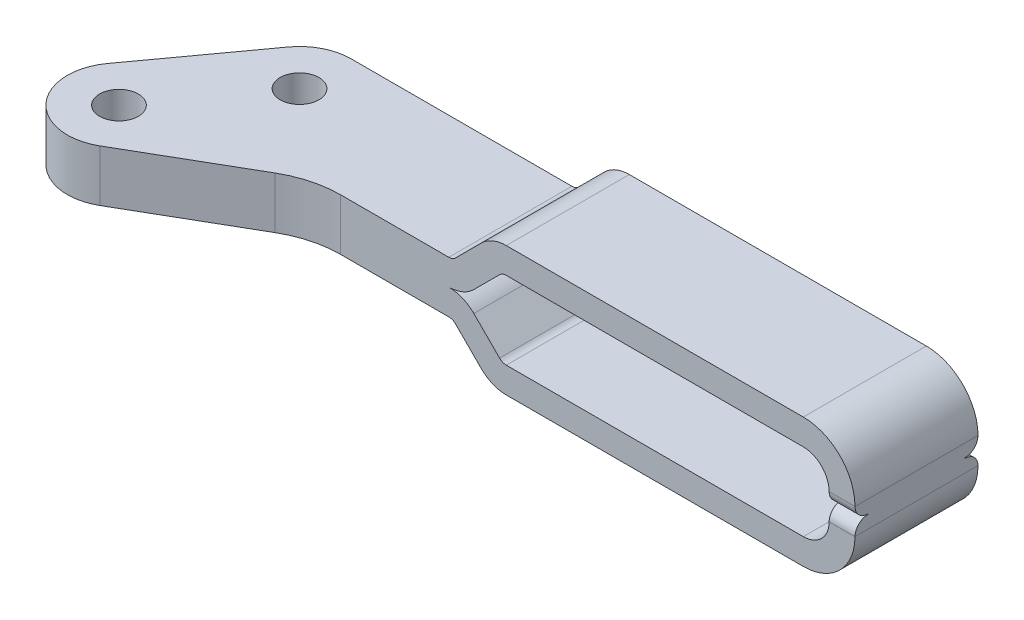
ISO-10303-21;
HEADER;
FILE_DESCRIPTION(('STEP AP214'),'2;1');
FILE_NAME('part.step','',(''),(''),'','','');
FILE_SCHEMA(('AUTOMOTIVE_DESIGN { 1 0 10303 214 1 1 1 1 }'));
ENDSEC;
DATA;
#1=APPLICATION_CONTEXT('core data for automotive mechanical design processes');
#2=APPLICATION_PROTOCOL_DEFINITION('international standard','automotive_design',2000,#1);
#3=PRODUCT_CONTEXT('',#1,'mechanical');
#4=PRODUCT('Part','Part','',(#3));
#5=PRODUCT_RELATED_PRODUCT_CATEGORY('part','',(#4));
#6=PRODUCT_DEFINITION_FORMATION('','',#4);
#7=PRODUCT_DEFINITION_CONTEXT('part definition',#1,'design');
#8=PRODUCT_DEFINITION('design','',#6,#7);
#9=PRODUCT_DEFINITION_SHAPE('','',#8);
#10=(LENGTH_UNIT() NAMED_UNIT(*) SI_UNIT(.MILLI.,.METRE.));
#11=(NAMED_UNIT(*) PLANE_ANGLE_UNIT() SI_UNIT($,.RADIAN.));
#12=(NAMED_UNIT(*) SI_UNIT($,.STERADIAN.) SOLID_ANGLE_UNIT());
#13=UNCERTAINTY_MEASURE_WITH_UNIT(LENGTH_MEASURE(1.E-05),#10,'distance_accuracy_value','');
#14=(GEOMETRIC_REPRESENTATION_CONTEXT(3) GLOBAL_UNCERTAINTY_ASSIGNED_CONTEXT((#13)) GLOBAL_UNIT_ASSIGNED_CONTEXT((#10,
#11,#12)) REPRESENTATION_CONTEXT('',''));
#15=CARTESIAN_POINT('',(0.,0.,0.));
#16=DIRECTION('',(0.,0.,1.));
#17=DIRECTION('',(1.,0.,0.));
#18=AXIS2_PLACEMENT_3D('',#15,#16,#17);
#19=CARTESIAN_POINT('',(52.4137206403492,1.02232003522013,-11.096318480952));
#20=DIRECTION('',(1.,0.,0.));
#21=DIRECTION('',(0.,1.,0.));
#22=AXIS2_PLACEMENT_3D('',#19,#20,#21);
#23=CYLINDRICAL_SURFACE('',#22,1.);
#24=CARTESIAN_POINT('',(54.4137206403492,1.02232003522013,-11.096318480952));
#25=DIRECTION('',(1.,0.,0.));
#26=DIRECTION('',(0.,1.,0.));
#27=AXIS2_PLACEMENT_3D('',#24,#25,#26);
#28=CIRCLE('',#27,1.);
#29=CARTESIAN_POINT('',(54.4137206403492,1.00993105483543,-12.0962417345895));
#30=VERTEX_POINT('',#29);
#31=CARTESIAN_POINT('',(54.4137206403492,0.0223200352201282,-11.096318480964));
#32=VERTEX_POINT('',#31);
#33=EDGE_CURVE('E279',#30,#32,#28,.F.);
#34=ORIENTED_EDGE('',*,*,#33,.T.);
#35=DIRECTION('',(-1.,0.,0.));
#36=VECTOR('',#35,1.);
#37=CARTESIAN_POINT('',(52.4137206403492,0.0223200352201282,-11.0963184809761));
#38=LINE('',#37,#36);
#39=CARTESIAN_POINT('',(52.4137206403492,0.0223200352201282,-11.096318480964));
#40=VERTEX_POINT('',#39);
#41=EDGE_CURVE('E566',#32,#40,#38,.T.);
#42=ORIENTED_EDGE('',*,*,#41,.T.);
#43=CARTESIAN_POINT('',(52.4137206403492,1.02232003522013,-11.096318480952));
#44=DIRECTION('',(1.,0.,0.));
#45=DIRECTION('',(0.,1.,0.));
#46=AXIS2_PLACEMENT_3D('',#43,#44,#45);
#47=CIRCLE('',#46,1.);
#48=CARTESIAN_POINT('',(52.4137206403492,1.00993105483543,-12.0962417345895));
#49=VERTEX_POINT('',#48);
#50=EDGE_CURVE('E656',#49,#40,#47,.F.);
#51=ORIENTED_EDGE('',*,*,#50,.F.);
#52=DIRECTION('',(1.,0.,0.));
#53=VECTOR('',#52,1.);
#54=CARTESIAN_POINT('',(53.4137206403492,1.00993105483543,-12.0962417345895));
#55=LINE('',#54,#53);
#56=EDGE_CURVE('E558',#49,#30,#55,.T.);
#57=ORIENTED_EDGE('',*,*,#56,.T.);
#58=EDGE_LOOP('',(#34,#42,#51,#57));
#59=FACE_BOUND('',#58,.T.);
#60=ADVANCED_FACE('F14',(#59),#23,.T.);
#61=CARTESIAN_POINT('',(52.4137206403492,1.02232003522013,-3.5713184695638));
#62=DIRECTION('',(1.,0.,0.));
#63=DIRECTION('',(0.,1.,0.));
#64=AXIS2_PLACEMENT_3D('',#61,#62,#63);
#65=CYLINDRICAL_SURFACE('',#64,1.);
#66=CARTESIAN_POINT('',(52.4137206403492,1.02232003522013,-3.5713184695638));
#67=DIRECTION('',(1.,0.,0.));
#68=DIRECTION('',(0.,1.,0.));
#69=AXIS2_PLACEMENT_3D('',#66,#67,#68);
#70=CIRCLE('',#69,1.);
#71=CARTESIAN_POINT('',(52.4137206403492,0.0223200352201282,-3.57131847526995));
#72=VERTEX_POINT('',#71);
#73=CARTESIAN_POINT('',(52.4137206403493,1.00993105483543,-2.57139521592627));
#74=VERTEX_POINT('',#73);
#75=EDGE_CURVE('E569',#72,#74,#70,.F.);
#76=ORIENTED_EDGE('',*,*,#75,.F.);
#77=DIRECTION('',(-1.,0.,0.));
#78=VECTOR('',#77,1.);
#79=CARTESIAN_POINT('',(52.4137206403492,0.0223200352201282,-3.57131848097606));
#80=LINE('',#79,#78);
#81=CARTESIAN_POINT('',(54.4137206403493,0.0223200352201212,-3.57131847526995));
#82=VERTEX_POINT('',#81);
#83=EDGE_CURVE('E561',#72,#82,#80,.F.);
#84=ORIENTED_EDGE('',*,*,#83,.T.);
#85=CARTESIAN_POINT('',(54.4137206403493,1.02232003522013,-3.57131846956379));
#86=DIRECTION('',(1.,0.,0.));
#87=DIRECTION('',(0.,1.,0.));
#88=AXIS2_PLACEMENT_3D('',#85,#86,#87);
#89=CIRCLE('',#88,1.);
#90=CARTESIAN_POINT('',(54.4137206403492,1.00993105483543,-2.57139521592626));
#91=VERTEX_POINT('',#90);
#92=EDGE_CURVE('E653',#82,#91,#89,.F.);
#93=ORIENTED_EDGE('',*,*,#92,.T.);
#94=DIRECTION('',(-1.,0.,0.));
#95=VECTOR('',#94,1.);
#96=CARTESIAN_POINT('',(53.4137206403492,1.00993105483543,-2.57139521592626));
#97=LINE('',#96,#95);
#98=EDGE_CURVE('E456',#91,#74,#97,.T.);
#99=ORIENTED_EDGE('',*,*,#98,.T.);
#100=EDGE_LOOP('',(#76,#84,#93,#99));
#101=FACE_BOUND('',#100,.T.);
#102=ADVANCED_FACE('F874',(#101),#65,.T.);
#103=CARTESIAN_POINT('',(52.4137206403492,1.02232003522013,-11.096318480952));
#104=DIRECTION('',(-1.,0.,0.));
#105=DIRECTION('',(0.,-1.,0.));
#106=AXIS2_PLACEMENT_3D('',#103,#104,#105);
#107=PLANE('',#106);
#108=ORIENTED_EDGE('',*,*,#50,.T.);
#109=DIRECTION('',(0.,1.,0.));
#110=VECTOR('',#109,1.);
#111=CARTESIAN_POINT('',(52.4137206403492,-7.80856592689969,-11.096318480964));
#112=LINE('',#111,#110);
#113=CARTESIAN_POINT('',(52.4137206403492,-0.0223200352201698,-11.096318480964));
#114=VERTEX_POINT('',#113);
#115=EDGE_CURVE('E262',#114,#40,#112,.T.);
#116=ORIENTED_EDGE('',*,*,#115,.F.);
#117=CARTESIAN_POINT('',(52.4137206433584,-1.02232003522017,-11.0963184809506));
#118=DIRECTION('',(-1.,0.,0.));
#119=DIRECTION('',(0.,-1.,0.));
#120=AXIS2_PLACEMENT_3D('',#117,#118,#119);
#121=CIRCLE('',#120,1.);
#122=CARTESIAN_POINT('',(52.4137206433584,-1.00993105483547,-12.0962417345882));
#123=VERTEX_POINT('',#122);
#124=EDGE_CURVE('E21',#123,#114,#121,.F.);
#125=ORIENTED_EDGE('',*,*,#124,.F.);
#126=DIRECTION('',(0.,0.,1.));
#127=VECTOR('',#126,1.);
#128=CARTESIAN_POINT('',(52.4137206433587,-1.00993105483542,-18.9863628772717));
#129=LINE('',#128,#127);
#130=CARTESIAN_POINT('',(52.4137206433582,-1.00993105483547,-2.57139521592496));
#131=VERTEX_POINT('',#130);
#132=EDGE_CURVE('E247',#123,#131,#129,.T.);
#133=ORIENTED_EDGE('',*,*,#132,.T.);
#134=CARTESIAN_POINT('',(52.4137206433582,-1.02232003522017,-3.57131846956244));
#135=DIRECTION('',(-1.,0.,0.));
#136=DIRECTION('',(0.,-1.,0.));
#137=AXIS2_PLACEMENT_3D('',#134,#135,#136);
#138=CIRCLE('',#137,1.);
#139=CARTESIAN_POINT('',(52.4137206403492,-0.022320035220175,-3.57131847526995));
#140=VERTEX_POINT('',#139);
#141=EDGE_CURVE('E228',#140,#131,#138,.F.);
#142=ORIENTED_EDGE('',*,*,#141,.F.);
#143=DIRECTION('',(0.,1.,0.));
#144=VECTOR('',#143,1.);
#145=CARTESIAN_POINT('',(52.4137206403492,-7.80856592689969,-3.57131847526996));
#146=LINE('',#145,#144);
#147=EDGE_CURVE('E637',#140,#72,#146,.T.);
#148=ORIENTED_EDGE('',*,*,#147,.T.);
#149=ORIENTED_EDGE('',*,*,#75,.T.);
#150=DIRECTION('',(0.,0.,1.));
#151=VECTOR('',#150,1.);
#152=CARTESIAN_POINT('',(52.4137206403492,1.00993105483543,-18.1473394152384));
#153=LINE('',#152,#151);
#154=EDGE_CURVE('E492',#74,#49,#153,.F.);
#155=ORIENTED_EDGE('',*,*,#154,.T.);
#156=EDGE_LOOP('',(#108,#116,#125,#133,#142,#148,#149,#155));
#157=FACE_BOUND('',#156,.T.);
#158=ADVANCED_FACE('F259',(#157),#107,.T.);
#159=CARTESIAN_POINT('',(54.4136865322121,1.02644964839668,-12.096318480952));
#160=CARTESIAN_POINT('',(54.4137092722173,1.02094317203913,-12.0963120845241));
#161=CARTESIAN_POINT('',(54.4137206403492,1.01543695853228,-12.0962865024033));
#162=CARTESIAN_POINT('',(54.4137206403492,1.00993105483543,-12.0962417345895));
#163=CARTESIAN_POINT('',(52.4137035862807,1.01819035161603,-12.096318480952));
#164=CARTESIAN_POINT('',(52.4137149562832,1.01543711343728,-12.0963120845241));
#165=CARTESIAN_POINT('',(52.4137206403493,1.01268400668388,-12.0962865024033));
#166=CARTESIAN_POINT('',(52.4137206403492,1.00993105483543,-12.0962417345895));
#167=B_SPLINE_SURFACE_WITH_KNOTS('',1,3,((#159,#160,#161,#162),(#163,#164,#165,#166)),
.UNSPECIFIED.,.F.,.F.,.F.,(2,2),(4,4),(0.,1.),(0.,1.),.UNSPECIFIED.);
#168=CARTESIAN_POINT('',(54.4137206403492,1.00993105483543,-12.0962417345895));
#169=CARTESIAN_POINT('',(54.4137206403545,1.01130764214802,-12.0962529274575));
#170=CARTESIAN_POINT('',(54.4137199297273,1.01268423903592,-12.0962629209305));
#171=CARTESIAN_POINT('',(54.4137170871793,1.01543744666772,-12.0962805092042));
#172=CARTESIAN_POINT('',(54.4137149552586,1.01681405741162,-12.096288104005));
#173=CARTESIAN_POINT('',(54.4137064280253,1.02094365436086,-12.0963072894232));
#174=CARTESIAN_POINT('',(54.413697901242,1.02369665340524,-12.0963152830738));
#175=CARTESIAN_POINT('',(54.4136865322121,1.02644964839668,-12.096318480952));
#176=B_SPLINE_CURVE_WITH_KNOTS('',3,(#168,#169,#170,#171,#172,#173,#174,#175),.UNSPECIFIED.,.F.,
.F.,(4,2,2,4),(0.,0.00412989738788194,0.00825979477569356,0.0165188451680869),.UNSPECIFIED.);
#177=CARTESIAN_POINT('',(54.4136865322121,1.02644964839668,-12.096318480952));
#178=VERTEX_POINT('',#177);
#179=EDGE_CURVE('E457',#30,#178,#176,.T.);
#180=CARTESIAN_POINT('',(52.4137206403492,1.00993105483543,-12.0962417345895));
#181=CARTESIAN_POINT('',(52.413720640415,1.01130746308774,-12.096264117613));
#182=CARTESIAN_POINT('',(52.4137192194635,1.01268394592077,-12.0962817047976));
#183=CARTESIAN_POINT('',(52.4137149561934,1.01474876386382,-12.0963008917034));
#184=CARTESIAN_POINT('',(52.4137131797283,1.01543706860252,-12.0963060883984));
#185=CARTESIAN_POINT('',(52.4137089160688,1.01681369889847,-12.0963140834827));
#186=CARTESIAN_POINT('',(52.413706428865,1.01750202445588,-12.0963168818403));
#187=CARTESIAN_POINT('',(52.4137035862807,1.01819035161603,-12.096318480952));
#188=B_SPLINE_CURVE_WITH_KNOTS('',3,(#180,#181,#182,#183,#184,#185,#186,#187),.UNSPECIFIED.,.F.,
.F.,(4,2,2,4),(0.,0.00412975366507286,0.00619472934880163,0.00825973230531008),.UNSPECIFIED.);
#189=CARTESIAN_POINT('',(52.4137035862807,1.01819035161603,-12.096318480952));
#190=VERTEX_POINT('',#189);
#191=EDGE_CURVE('E485',#49,#190,#188,.T.);
#192=DIRECTION('',(0.999991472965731,0.00412964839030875,0.));
#193=VECTOR('',#192,1.);
#194=CARTESIAN_POINT('',(52.4137035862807,1.01819035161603,-12.096318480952));
#195=LINE('',#194,#193);
#196=EDGE_CURVE('E495',#190,#178,#195,.T.);
#197=ORIENTED_EDGE('',*,*,#179,.F.);
#198=ORIENTED_EDGE('',*,*,#56,.F.);
#199=ORIENTED_EDGE('',*,*,#191,.T.);
#200=ORIENTED_EDGE('',*,*,#196,.T.);
#201=EDGE_LOOP('',(#197,#198,#199,#200));
#202=FACE_BOUND('',#201,.T.);
#203=ADVANCED_FACE('F427',(#202),#167,.F.);
#204=CARTESIAN_POINT('',(54.4137206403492,1.00993105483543,-2.57139521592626));
#205=CARTESIAN_POINT('',(54.4137206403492,1.01543695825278,-2.57135044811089));
#206=CARTESIAN_POINT('',(54.4137092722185,1.02094317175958,-2.57132486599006));
#207=CARTESIAN_POINT('',(54.4136865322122,1.02644964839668,-2.57131846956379));
#208=CARTESIAN_POINT('',(52.4137206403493,1.00993105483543,-2.57139521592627));
#209=CARTESIAN_POINT('',(52.4137206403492,1.01268400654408,-2.5713504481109));
#210=CARTESIAN_POINT('',(52.4137149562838,1.01543711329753,-2.57132486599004));
#211=CARTESIAN_POINT('',(52.4137035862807,1.01819035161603,-2.57131846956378));
#212=B_SPLINE_SURFACE_WITH_KNOTS('',1,3,((#204,#205,#206,#207),(#208,#209,#210,#211)),
.UNSPECIFIED.,.F.,.F.,.F.,(2,2),(4,4),(0.,1.),(0.,1.),.UNSPECIFIED.);
#213=CARTESIAN_POINT('',(54.4136865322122,1.02644964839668,-2.57131846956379));
#214=CARTESIAN_POINT('',(54.4136922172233,1.02507302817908,-2.57132006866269));
#215=CARTESIAN_POINT('',(54.4136971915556,1.02369640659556,-2.57132286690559));
#216=CARTESIAN_POINT('',(54.4137057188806,1.02094316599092,-2.57133086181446));
#217=CARTESIAN_POINT('',(54.4137092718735,1.0195665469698,-2.57133605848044));
#218=CARTESIAN_POINT('',(54.4137177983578,1.01543695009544,-2.57135524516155));
#219=CARTESIAN_POINT('',(54.413720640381,1.01268398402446,-2.57137283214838));
#220=CARTESIAN_POINT('',(54.4137206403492,1.00993105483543,-2.57139521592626));
#221=B_SPLINE_CURVE_WITH_KNOTS('',3,(#213,#214,#215,#216,#217,#218,#219,#220),.UNSPECIFIED.,.F.,
.F.,(4,2,2,4),(0.,0.00412989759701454,0.00825979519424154,0.0165188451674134),.UNSPECIFIED.);
#222=CARTESIAN_POINT('',(54.4136865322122,1.02644964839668,-2.57131846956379));
#223=VERTEX_POINT('',#222);
#224=EDGE_CURVE('E448',#223,#91,#221,.T.);
#225=DIRECTION('',(-0.999991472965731,-0.00412964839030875,0.));
#226=VECTOR('',#225,1.);
#227=CARTESIAN_POINT('',(54.4136865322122,1.02644964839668,-2.57131846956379));
#228=LINE('',#227,#226);
#229=CARTESIAN_POINT('',(52.4137035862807,1.01819035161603,-2.57131846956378));
#230=VERTEX_POINT('',#229);
#231=EDGE_CURVE('E499',#223,#230,#228,.T.);
#232=CARTESIAN_POINT('',(52.4137035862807,1.01819035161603,-2.57131846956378));
#233=CARTESIAN_POINT('',(52.4137092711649,1.0168137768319,-2.57132166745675));
#234=CARTESIAN_POINT('',(52.4137135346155,1.0154372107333,-2.57132966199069));
#235=CARTESIAN_POINT('',(52.4137177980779,1.01337239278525,-2.57134884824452));
#236=CARTESIAN_POINT('',(52.4137188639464,1.01268410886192,-2.57135644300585));
#237=CARTESIAN_POINT('',(52.4137202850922,1.01130756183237,-2.57137403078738));
#238=CARTESIAN_POINT('',(52.4137206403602,1.01061929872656,-2.57138402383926));
#239=CARTESIAN_POINT('',(52.4137206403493,1.00993105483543,-2.57139521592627));
#240=B_SPLINE_CURVE_WITH_KNOTS('',3,(#232,#233,#234,#235,#236,#237,#238,#239),.UNSPECIFIED.,.F.,
.F.,(4,2,2,4),(0.,0.00412975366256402,0.00619472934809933,0.00825973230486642),.UNSPECIFIED.);
#241=EDGE_CURVE('E440',#230,#74,#240,.T.);
#242=ORIENTED_EDGE('',*,*,#224,.F.);
#243=ORIENTED_EDGE('',*,*,#231,.T.);
#244=ORIENTED_EDGE('',*,*,#241,.T.);
#245=ORIENTED_EDGE('',*,*,#98,.F.);
#246=EDGE_LOOP('',(#242,#243,#244,#245));
#247=FACE_BOUND('',#246,.T.);
#248=ADVANCED_FACE('F420',(#247),#212,.F.);
#249=CARTESIAN_POINT('',(50.4137206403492,1.00993105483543,-18.1473394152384));
#250=DIRECTION('',(0.,0.,1.));
#251=DIRECTION('',(0.,-1.,0.));
#252=AXIS2_PLACEMENT_3D('',#249,#250,#251);
#253=CYLINDRICAL_SURFACE('',#252,2.);
#254=CARTESIAN_POINT('',(50.4137206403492,1.00993105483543,-12.096318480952));
#255=DIRECTION('',(0.,0.,1.));
#256=DIRECTION('',(0.,-1.,0.));
#257=AXIS2_PLACEMENT_3D('',#254,#255,#256);
#258=CIRCLE('',#257,2.);
#259=CARTESIAN_POINT('',(50.4137206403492,3.00993105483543,-12.096318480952));
#260=VERTEX_POINT('',#259);
#261=EDGE_CURVE('E491',#260,#190,#258,.F.);
#262=ORIENTED_EDGE('',*,*,#261,.T.);
#263=ORIENTED_EDGE('',*,*,#191,.F.);
#264=ORIENTED_EDGE('',*,*,#154,.F.);
#265=ORIENTED_EDGE('',*,*,#241,.F.);
#266=CARTESIAN_POINT('',(50.4137206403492,1.00993105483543,-2.57131846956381));
#267=DIRECTION('',(0.,0.,1.));
#268=DIRECTION('',(0.,-1.,0.));
#269=AXIS2_PLACEMENT_3D('',#266,#267,#268);
#270=CIRCLE('',#269,2.);
#271=CARTESIAN_POINT('',(50.4137206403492,3.00993105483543,-2.57131846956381));
#272=VERTEX_POINT('',#271);
#273=EDGE_CURVE('E496',#230,#272,#270,.T.);
#274=ORIENTED_EDGE('',*,*,#273,.T.);
#275=DIRECTION('',(0.,0.,1.));
#276=VECTOR('',#275,1.);
#277=CARTESIAN_POINT('',(50.4137206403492,3.00993105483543,-11.096318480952));
#278=LINE('',#277,#276);
#279=EDGE_CURVE('E504',#260,#272,#278,.T.);
#280=ORIENTED_EDGE('',*,*,#279,.F.);
#281=EDGE_LOOP('',(#262,#263,#264,#265,#274,#280));
#282=FACE_BOUND('',#281,.T.);
#283=ADVANCED_FACE('F426',(#282),#253,.F.);
#284=CARTESIAN_POINT('',(54.4137206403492,1.02232003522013,-11.096318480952));
#285=DIRECTION('',(-1.,0.,0.));
#286=DIRECTION('',(0.,-1.,0.));
#287=AXIS2_PLACEMENT_3D('',#284,#285,#286);
#288=PLANE('',#287);
#289=DIRECTION('',(0.,0.,1.));
#290=VECTOR('',#289,1.);
#291=CARTESIAN_POINT('',(54.4137206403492,1.00993105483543,-18.1473394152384));
#292=LINE('',#291,#290);
#293=EDGE_CURVE('E503',#91,#30,#292,.F.);
#294=ORIENTED_EDGE('',*,*,#293,.F.);
#295=ORIENTED_EDGE('',*,*,#92,.F.);
#296=DIRECTION('',(0.,1.,0.));
#297=VECTOR('',#296,1.);
#298=CARTESIAN_POINT('',(54.4137206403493,-7.80856592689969,-3.57131847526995));
#299=LINE('',#298,#297);
#300=CARTESIAN_POINT('',(54.4137206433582,-0.0223200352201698,-3.57131847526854));
#301=VERTEX_POINT('',#300);
#302=EDGE_CURVE('E635',#301,#82,#299,.T.);
#303=ORIENTED_EDGE('',*,*,#302,.F.);
#304=CARTESIAN_POINT('',(54.4137206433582,-1.02232003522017,-3.57131846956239));
#305=DIRECTION('',(-1.,0.,0.));
#306=DIRECTION('',(0.,-1.,0.));
#307=AXIS2_PLACEMENT_3D('',#304,#305,#306);
#308=CIRCLE('',#307,1.);
#309=CARTESIAN_POINT('',(54.4137206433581,-1.00993105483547,-2.57139521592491));
#310=VERTEX_POINT('',#309);
#311=EDGE_CURVE('E651',#301,#310,#308,.F.);
#312=ORIENTED_EDGE('',*,*,#311,.T.);
#313=DIRECTION('',(0.,0.,1.));
#314=VECTOR('',#313,1.);
#315=CARTESIAN_POINT('',(54.4137206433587,-1.00993105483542,-18.9863628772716));
#316=LINE('',#315,#314);
#317=CARTESIAN_POINT('',(54.4137206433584,-1.00993105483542,-12.0962417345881));
#318=VERTEX_POINT('',#317);
#319=EDGE_CURVE('E342',#318,#310,#316,.T.);
#320=ORIENTED_EDGE('',*,*,#319,.F.);
#321=CARTESIAN_POINT('',(54.4137206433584,-1.02232003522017,-11.0963184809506));
#322=DIRECTION('',(-1.,0.,0.));
#323=DIRECTION('',(0.,-1.,0.));
#324=AXIS2_PLACEMENT_3D('',#321,#322,#323);
#325=CIRCLE('',#324,1.);
#326=CARTESIAN_POINT('',(54.4137206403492,-0.0223200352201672,-11.096318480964));
#327=VERTEX_POINT('',#326);
#328=EDGE_CURVE('E269',#318,#327,#325,.F.);
#329=ORIENTED_EDGE('',*,*,#328,.T.);
#330=DIRECTION('',(0.,1.,0.));
#331=VECTOR('',#330,1.);
#332=CARTESIAN_POINT('',(54.4137206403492,-7.80856592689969,-11.096318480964));
#333=LINE('',#332,#331);
#334=EDGE_CURVE('E632',#327,#32,#333,.T.);
#335=ORIENTED_EDGE('',*,*,#334,.T.);
#336=ORIENTED_EDGE('',*,*,#33,.F.);
#337=EDGE_LOOP('',(#294,#295,#303,#312,#320,#329,#335,#336));
#338=FACE_BOUND('',#337,.T.);
#339=ADVANCED_FACE('F475',(#338),#288,.F.);
#340=CARTESIAN_POINT('',(55.1137206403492,3.00993105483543,-11.096318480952));
#341=DIRECTION('',(0.,-1.,0.));
#342=DIRECTION('',(1.,0.,0.));
#343=AXIS2_PLACEMENT_3D('',#340,#341,#342);
#344=PLANE('',#343);
#345=DIRECTION('',(1.,0.,0.));
#346=VECTOR('',#345,1.);
#347=CARTESIAN_POINT('',(18.0692459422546,3.00993105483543,-2.5713184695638));
#348=LINE('',#347,#346);
#349=CARTESIAN_POINT('',(27.4176430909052,3.00993105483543,-2.57131846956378));
#350=VERTEX_POINT('',#349);
#351=EDGE_CURVE('E582',#272,#350,#348,.F.);
#352=ORIENTED_EDGE('',*,*,#351,.T.);
#353=DIRECTION('',(0.,0.,-1.));
#354=VECTOR('',#353,1.);
#355=CARTESIAN_POINT('',(27.4176430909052,3.00993105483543,2.49399459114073));
#356=LINE('',#355,#354);
#357=CARTESIAN_POINT('',(27.4176430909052,3.00993105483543,-12.096318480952));
#358=VERTEX_POINT('',#357);
#359=EDGE_CURVE('E585',#350,#358,#356,.T.);
#360=ORIENTED_EDGE('',*,*,#359,.T.);
#361=DIRECTION('',(1.,0.,0.));
#362=VECTOR('',#361,1.);
#363=CARTESIAN_POINT('',(55.1137206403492,3.00993105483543,-12.096318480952));
#364=LINE('',#363,#362);
#365=EDGE_CURVE('E507',#358,#260,#364,.T.);
#366=ORIENTED_EDGE('',*,*,#365,.T.);
#367=ORIENTED_EDGE('',*,*,#279,.T.);
#368=EDGE_LOOP('',(#352,#360,#366,#367));
#369=FACE_BOUND('',#368,.T.);
#370=ADVANCED_FACE('F469',(#369),#344,.T.);
#371=CARTESIAN_POINT('',(50.4137206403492,1.00993105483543,-18.1473394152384));
#372=DIRECTION('',(0.,0.,1.));
#373=DIRECTION('',(0.,-1.,0.));
#374=AXIS2_PLACEMENT_3D('',#371,#372,#373);
#375=CYLINDRICAL_SURFACE('',#374,4.);
#376=ORIENTED_EDGE('',*,*,#179,.T.);
#377=CARTESIAN_POINT('',(50.4137206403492,1.00993105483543,-12.096318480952));
#378=DIRECTION('',(0.,0.,1.));
#379=DIRECTION('',(0.,-1.,0.));
#380=AXIS2_PLACEMENT_3D('',#377,#378,#379);
#381=CIRCLE('',#380,4.);
#382=CARTESIAN_POINT('',(50.4137206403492,5.00993105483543,-12.096318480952));
#383=VERTEX_POINT('',#382);
#384=EDGE_CURVE('E505',#178,#383,#381,.T.);
#385=ORIENTED_EDGE('',*,*,#384,.T.);
#386=DIRECTION('',(0.,0.,1.));
#387=VECTOR('',#386,1.);
#388=CARTESIAN_POINT('',(50.4137206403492,5.00993105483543,-11.096318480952));
#389=LINE('',#388,#387);
#390=CARTESIAN_POINT('',(50.4137206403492,5.00993105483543,-2.57131846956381));
#391=VERTEX_POINT('',#390);
#392=EDGE_CURVE('E512',#383,#391,#389,.T.);
#393=ORIENTED_EDGE('',*,*,#392,.T.);
#394=CARTESIAN_POINT('',(50.4137206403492,1.00993105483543,-2.57131846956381));
#395=DIRECTION('',(0.,0.,1.));
#396=DIRECTION('',(0.,-1.,0.));
#397=AXIS2_PLACEMENT_3D('',#394,#395,#396);
#398=CIRCLE('',#397,4.);
#399=EDGE_CURVE('E500',#391,#223,#398,.F.);
#400=ORIENTED_EDGE('',*,*,#399,.T.);
#401=ORIENTED_EDGE('',*,*,#224,.T.);
#402=ORIENTED_EDGE('',*,*,#293,.T.);
#403=EDGE_LOOP('',(#376,#385,#393,#400,#401,#402));
#404=FACE_BOUND('',#403,.T.);
#405=ADVANCED_FACE('F463',(#404),#375,.T.);
#406=CARTESIAN_POINT('',(27.4176430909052,2.27333105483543,2.49399459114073));
#407=DIRECTION('',(0.,0.,-1.));
#408=DIRECTION('',(1.,0.,0.));
#409=AXIS2_PLACEMENT_3D('',#406,#407,#408);
#410=CYLINDRICAL_SURFACE('',#409,0.7366);
#411=CARTESIAN_POINT('',(27.4176430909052,2.27333105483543,-2.57131846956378));
#412=DIRECTION('',(0.,0.,-1.));
#413=DIRECTION('',(1.,0.,0.));
#414=AXIS2_PLACEMENT_3D('',#411,#412,#413);
#415=CIRCLE('',#414,0.7366);
#416=CARTESIAN_POINT('',(26.8967882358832,2.79418590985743,-2.57131846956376));
#417=VERTEX_POINT('',#416);
#418=EDGE_CURVE('E511',#350,#417,#415,.F.);
#419=ORIENTED_EDGE('',*,*,#418,.T.);
#420=DIRECTION('',(0.,0.,1.));
#421=VECTOR('',#420,1.);
#422=CARTESIAN_POINT('',(26.8967882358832,2.79418590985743,-11.096318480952));
#423=LINE('',#422,#421);
#424=CARTESIAN_POINT('',(26.8967882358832,2.79418590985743,-12.096318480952));
#425=VERTEX_POINT('',#424);
#426=EDGE_CURVE('E515',#425,#417,#423,.T.);
#427=ORIENTED_EDGE('',*,*,#426,.F.);
#428=CARTESIAN_POINT('',(27.4176430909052,2.27333105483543,-12.096318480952));
#429=DIRECTION('',(0.,0.,-1.));
#430=DIRECTION('',(1.,0.,0.));
#431=AXIS2_PLACEMENT_3D('',#428,#429,#430);
#432=CIRCLE('',#431,0.7366);
#433=EDGE_CURVE('E508',#425,#358,#432,.T.);
#434=ORIENTED_EDGE('',*,*,#433,.T.);
#435=ORIENTED_EDGE('',*,*,#359,.F.);
#436=EDGE_LOOP('',(#419,#427,#434,#435));
#437=FACE_BOUND('',#436,.T.);
#438=ADVANCED_FACE('F468',(#437),#410,.F.);
#439=CARTESIAN_POINT('',(55.1137206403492,5.00993105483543,-11.096318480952));
#440=DIRECTION('',(0.,-1.,0.));
#441=DIRECTION('',(1.,0.,0.));
#442=AXIS2_PLACEMENT_3D('',#439,#440,#441);
#443=PLANE('',#442);
#444=DIRECTION('',(1.,0.,0.));
#445=VECTOR('',#444,1.);
#446=CARTESIAN_POINT('',(55.1137206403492,5.00993105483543,-12.096318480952));
#447=LINE('',#446,#445);
#448=CARTESIAN_POINT('',(27.4176430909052,5.00993105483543,-12.096318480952));
#449=VERTEX_POINT('',#448);
#450=EDGE_CURVE('E579',#449,#383,#447,.T.);
#451=ORIENTED_EDGE('',*,*,#450,.F.);
#452=DIRECTION('',(0.,0.,-1.));
#453=VECTOR('',#452,1.);
#454=CARTESIAN_POINT('',(27.4176430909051,5.00993105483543,2.49399459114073));
#455=LINE('',#454,#453);
#456=CARTESIAN_POINT('',(27.4176430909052,5.00993105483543,-2.57131846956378));
#457=VERTEX_POINT('',#456);
#458=EDGE_CURVE('E519',#457,#449,#455,.T.);
#459=ORIENTED_EDGE('',*,*,#458,.F.);
#460=DIRECTION('',(1.,0.,0.));
#461=VECTOR('',#460,1.);
#462=CARTESIAN_POINT('',(55.1137206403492,5.00993105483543,-2.5713184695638));
#463=LINE('',#462,#461);
#464=EDGE_CURVE('E588',#391,#457,#463,.F.);
#465=ORIENTED_EDGE('',*,*,#464,.F.);
#466=ORIENTED_EDGE('',*,*,#392,.F.);
#467=EDGE_LOOP('',(#451,#459,#465,#466));
#468=FACE_BOUND('',#467,.T.);
#469=ADVANCED_FACE('F748',(#468),#443,.F.);
#470=CARTESIAN_POINT('',(47.4453112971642,23.3427089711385,-11.096318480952));
#471=DIRECTION('',(0.707106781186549,-0.707106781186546,0.));
#472=DIRECTION('',(0.707106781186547,0.707106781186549,0.));
#473=AXIS2_PLACEMENT_3D('',#470,#471,#472);
#474=PLANE('',#473);
#475=DIRECTION('',(-0.707106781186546,-0.707106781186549,0.));
#476=VECTOR('',#475,1.);
#477=CARTESIAN_POINT('',(26.8967882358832,2.79418590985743,-2.57131846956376));
#478=LINE('',#477,#476);
#479=CARTESIAN_POINT('',(24.9041339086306,0.801531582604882,-2.57131846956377));
#480=VERTEX_POINT('',#479);
#481=EDGE_CURVE('E522',#417,#480,#478,.T.);
#482=ORIENTED_EDGE('',*,*,#481,.T.);
#483=DIRECTION('',(0.,0.,-1.));
#484=VECTOR('',#483,1.);
#485=CARTESIAN_POINT('',(24.9041339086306,0.801531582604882,2.49399459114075));
#486=LINE('',#485,#484);
#487=CARTESIAN_POINT('',(24.9041339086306,0.801531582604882,-12.096318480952));
#488=VERTEX_POINT('',#487);
#489=EDGE_CURVE('E526',#488,#480,#486,.F.);
#490=ORIENTED_EDGE('',*,*,#489,.F.);
#491=DIRECTION('',(0.707106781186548,0.707106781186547,0.));
#492=VECTOR('',#491,1.);
#493=CARTESIAN_POINT('',(24.9041339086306,0.801531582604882,-12.096318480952));
#494=LINE('',#493,#492);
#495=EDGE_CURVE('E594',#488,#425,#494,.T.);
#496=ORIENTED_EDGE('',*,*,#495,.T.);
#497=ORIENTED_EDGE('',*,*,#426,.T.);
#498=EDGE_LOOP('',(#482,#490,#496,#497));
#499=FACE_BOUND('',#498,.T.);
#500=ADVANCED_FACE('F974',(#499),#474,.T.);
#501=CARTESIAN_POINT('',(27.4176430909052,2.27333105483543,2.49399459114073));
#502=DIRECTION('',(0.,0.,-1.));
#503=DIRECTION('',(1.,0.,0.));
#504=AXIS2_PLACEMENT_3D('',#501,#502,#503);
#505=CYLINDRICAL_SURFACE('',#504,2.7366);
#506=DIRECTION('',(0.,0.,1.));
#507=VECTOR('',#506,1.);
#508=CARTESIAN_POINT('',(25.4825746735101,4.20839947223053,-11.096318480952));
#509=LINE('',#508,#507);
#510=CARTESIAN_POINT('',(25.4825746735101,4.20839947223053,-12.096318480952));
#511=VERTEX_POINT('',#510);
#512=CARTESIAN_POINT('',(25.4825746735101,4.20839947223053,-2.57131846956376));
#513=VERTEX_POINT('',#512);
#514=EDGE_CURVE('E534',#511,#513,#509,.T.);
#515=ORIENTED_EDGE('',*,*,#514,.T.);
#516=CARTESIAN_POINT('',(27.4176430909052,2.27333105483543,-2.57131846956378));
#517=DIRECTION('',(0.,0.,-1.));
#518=DIRECTION('',(1.,0.,0.));
#519=AXIS2_PLACEMENT_3D('',#516,#517,#518);
#520=CIRCLE('',#519,2.7366);
#521=EDGE_CURVE('E518',#513,#457,#520,.T.);
#522=ORIENTED_EDGE('',*,*,#521,.T.);
#523=ORIENTED_EDGE('',*,*,#458,.T.);
#524=CARTESIAN_POINT('',(27.4176430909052,2.27333105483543,-12.096318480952));
#525=DIRECTION('',(0.,0.,-1.));
#526=DIRECTION('',(1.,0.,0.));
#527=AXIS2_PLACEMENT_3D('',#524,#525,#526);
#528=CIRCLE('',#527,2.7366);
#529=EDGE_CURVE('E516',#449,#511,#528,.F.);
#530=ORIENTED_EDGE('',*,*,#529,.T.);
#531=EDGE_LOOP('',(#515,#522,#523,#530));
#532=FACE_BOUND('',#531,.T.);
#533=ADVANCED_FACE('F755',(#532),#505,.T.);
#534=CARTESIAN_POINT('',(22.9690654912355,2.7366,2.49399459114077));
#535=DIRECTION('',(0.,0.,-1.));
#536=DIRECTION('',(0.,1.,0.));
#537=AXIS2_PLACEMENT_3D('',#534,#535,#536);
#538=CYLINDRICAL_SURFACE('',#537,2.7366);
#539=ORIENTED_EDGE('',*,*,#489,.T.);
#540=CARTESIAN_POINT('',(22.9690654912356,2.7366,-2.5713184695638));
#541=DIRECTION('',(0.,0.,-1.));
#542=DIRECTION('',(0.,1.,0.));
#543=AXIS2_PLACEMENT_3D('',#540,#541,#542);
#544=CIRCLE('',#543,2.7366);
#545=CARTESIAN_POINT('',(22.9690654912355,0.,-2.5713184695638));
#546=VERTEX_POINT('',#545);
#547=EDGE_CURVE('E530',#546,#480,#544,.F.);
#548=ORIENTED_EDGE('',*,*,#547,.F.);
#549=DIRECTION('',(0.,0.,-1.));
#550=VECTOR('',#549,1.);
#551=CARTESIAN_POINT('',(22.9690654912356,0.,-11.096318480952));
#552=LINE('',#551,#550);
#553=CARTESIAN_POINT('',(22.9690654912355,0.,-12.096318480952));
#554=VERTEX_POINT('',#553);
#555=EDGE_CURVE('E533',#554,#546,#552,.F.);
#556=ORIENTED_EDGE('',*,*,#555,.F.);
#557=CARTESIAN_POINT('',(22.9690654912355,2.7366,-12.096318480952));
#558=DIRECTION('',(0.,0.,-1.));
#559=DIRECTION('',(0.,1.,0.));
#560=AXIS2_PLACEMENT_3D('',#557,#558,#559);
#561=CIRCLE('',#560,2.7366);
#562=EDGE_CURVE('E525',#488,#554,#561,.T.);
#563=ORIENTED_EDGE('',*,*,#562,.F.);
#564=EDGE_LOOP('',(#539,#548,#556,#563));
#565=FACE_BOUND('',#564,.T.);
#566=ADVANCED_FACE('F730',(#565),#538,.T.);
#567=CARTESIAN_POINT('',(46.0310977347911,24.7569225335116,-11.096318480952));
#568=DIRECTION('',(0.707106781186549,-0.707106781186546,0.));
#569=DIRECTION('',(0.707106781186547,0.707106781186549,0.));
#570=AXIS2_PLACEMENT_3D('',#567,#568,#569);
#571=PLANE('',#570);
#572=DIRECTION('',(0.707106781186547,0.707106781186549,0.));
#573=VECTOR('',#572,1.);
#574=CARTESIAN_POINT('',(46.0310977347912,24.7569225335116,-12.096318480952));
#575=LINE('',#574,#573);
#576=CARTESIAN_POINT('',(23.4899203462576,2.21574514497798,-12.096318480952));
#577=VERTEX_POINT('',#576);
#578=EDGE_CURVE('E600',#577,#511,#575,.T.);
#579=ORIENTED_EDGE('',*,*,#578,.F.);
#580=DIRECTION('',(0.,0.,-1.));
#581=VECTOR('',#580,1.);
#582=CARTESIAN_POINT('',(23.4899203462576,2.21574514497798,2.49399459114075));
#583=LINE('',#582,#581);
#584=CARTESIAN_POINT('',(23.4899203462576,2.21574514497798,-2.57131846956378));
#585=VERTEX_POINT('',#584);
#586=EDGE_CURVE('E537',#577,#585,#583,.F.);
#587=ORIENTED_EDGE('',*,*,#586,.T.);
#588=DIRECTION('',(0.707106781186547,0.707106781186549,0.));
#589=VECTOR('',#588,1.);
#590=CARTESIAN_POINT('',(46.0310977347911,24.7569225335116,-2.57131846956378));
#591=LINE('',#590,#589);
#592=EDGE_CURVE('E529',#513,#585,#591,.F.);
#593=ORIENTED_EDGE('',*,*,#592,.F.);
#594=ORIENTED_EDGE('',*,*,#514,.F.);
#595=EDGE_LOOP('',(#579,#587,#593,#594));
#596=FACE_BOUND('',#595,.T.);
#597=ADVANCED_FACE('F757',(#596),#571,.F.);
#598=CARTESIAN_POINT('',(5.88231968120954,0.,-8.09631847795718));
#599=DIRECTION('',(0.,1.,0.));
#600=DIRECTION('',(0.,0.,1.));
#601=AXIS2_PLACEMENT_3D('',#598,#599,#600);
#602=CYLINDRICAL_SURFACE('',#601,1.5);
#603=CARTESIAN_POINT('',(5.88231968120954,2.,-8.09631847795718));
#604=DIRECTION('',(0.,1.,0.));
#605=DIRECTION('',(0.,0.,1.));
#606=AXIS2_PLACEMENT_3D('',#603,#604,#605);
#607=CIRCLE('',#606,1.5);
#608=CARTESIAN_POINT('',(5.88231968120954,2.,-6.59631847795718));
#609=VERTEX_POINT('',#608);
#610=EDGE_CURVE('E538',#609,#609,#607,.T.);
#611=ORIENTED_EDGE('',*,*,#610,.T.);
#612=EDGE_LOOP('',(#611));
#613=FACE_BOUND('',#612,.T.);
#614=CARTESIAN_POINT('',(5.88231968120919,-2.,-8.09631847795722));
#615=DIRECTION('',(0.,1.,0.));
#616=DIRECTION('',(-1.,0.,0.));
#617=AXIS2_PLACEMENT_3D('',#614,#615,#616);
#618=CIRCLE('',#617,1.5);
#619=CARTESIAN_POINT('',(4.38231968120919,-2.,-8.09631847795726));
#620=VERTEX_POINT('',#619);
#621=EDGE_CURVE('E276',#620,#620,#618,.T.);
#622=ORIENTED_EDGE('',*,*,#621,.F.);
#623=EDGE_LOOP('',(#622));
#624=FACE_BOUND('',#623,.T.);
#625=ADVANCED_FACE('F1006',(#613,#624),#602,.F.);
#626=CARTESIAN_POINT('',(0.,0.,0.));
#627=DIRECTION('',(0.,1.,0.));
#628=DIRECTION('',(0.,0.,1.));
#629=AXIS2_PLACEMENT_3D('',#626,#627,#628);
#630=CYLINDRICAL_SURFACE('',#629,1.50000000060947);
#631=CARTESIAN_POINT('',(0.,2.,0.));
#632=DIRECTION('',(0.,1.,0.));
#633=DIRECTION('',(0.,0.,1.));
#634=AXIS2_PLACEMENT_3D('',#631,#632,#633);
#635=CIRCLE('',#634,1.50000000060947);
#636=CARTESIAN_POINT('',(0.,2.,1.50000000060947));
#637=VERTEX_POINT('',#636);
#638=EDGE_CURVE('E541',#637,#637,#635,.T.);
#639=ORIENTED_EDGE('',*,*,#638,.T.);
#640=EDGE_LOOP('',(#639));
#641=FACE_BOUND('',#640,.T.);
#642=CARTESIAN_POINT('',(-5.90673343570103E-13,-2.,-2.01227923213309E-13));
#643=DIRECTION('',(0.,1.,0.));
#644=DIRECTION('',(-1.,0.,0.));
#645=AXIS2_PLACEMENT_3D('',#642,#643,#644);
#646=CIRCLE('',#645,1.50000000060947);
#647=CARTESIAN_POINT('',(-1.50000000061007,-2.,-2.45410679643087E-13));
#648=VERTEX_POINT('',#647);
#649=EDGE_CURVE('E280',#648,#648,#646,.T.);
#650=ORIENTED_EDGE('',*,*,#649,.F.);
#651=EDGE_LOOP('',(#650));
#652=FACE_BOUND('',#651,.T.);
#653=ADVANCED_FACE('F1015',(#641,#652),#630,.F.);
#654=CARTESIAN_POINT('',(14.597247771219,0.,5.42868152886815));
#655=DIRECTION('',(0.,1.,0.));
#656=DIRECTION('',(0.,0.,1.));
#657=AXIS2_PLACEMENT_3D('',#654,#655,#656);
#658=CYLINDRICAL_SURFACE('',#657,7.99999999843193);
#659=DIRECTION('',(0.,-1.,0.));
#660=VECTOR('',#659,1.);
#661=CARTESIAN_POINT('',(10.5972477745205,0.,-1.49952170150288));
#662=LINE('',#661,#660);
#663=CARTESIAN_POINT('',(10.5972477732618,2.,-1.49952170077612));
#664=VERTEX_POINT('',#663);
#665=CARTESIAN_POINT('',(10.5972477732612,-2.,-1.49952170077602));
#666=VERTEX_POINT('',#665);
#667=EDGE_CURVE('E611',#664,#666,#662,.T.);
#668=ORIENTED_EDGE('',*,*,#667,.T.);
#669=CARTESIAN_POINT('',(14.5972477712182,-2.,5.42868152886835));
#670=DIRECTION('',(0.,1.,0.));
#671=DIRECTION('',(-1.,0.,0.));
#672=AXIS2_PLACEMENT_3D('',#669,#670,#671);
#673=CIRCLE('',#672,7.99999999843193);
#674=CARTESIAN_POINT('',(14.5972477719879,-2.,-2.57131846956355));
#675=VERTEX_POINT('',#674);
#676=EDGE_CURVE('E299',#675,#666,#673,.T.);
#677=ORIENTED_EDGE('',*,*,#676,.F.);
#678=DIRECTION('',(0.,1.,0.));
#679=VECTOR('',#678,1.);
#680=CARTESIAN_POINT('',(14.5972477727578,0.,-2.57131846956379));
#681=LINE('',#680,#679);
#682=CARTESIAN_POINT('',(14.5972477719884,2.,-2.5713184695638));
#683=VERTEX_POINT('',#682);
#684=EDGE_CURVE('E536',#675,#683,#681,.T.);
#685=ORIENTED_EDGE('',*,*,#684,.T.);
#686=CARTESIAN_POINT('',(14.597247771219,2.,5.42868152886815));
#687=DIRECTION('',(0.,1.,0.));
#688=DIRECTION('',(0.,0.,1.));
#689=AXIS2_PLACEMENT_3D('',#686,#687,#688);
#690=CIRCLE('',#689,7.99999999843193);
#691=EDGE_CURVE('E544',#683,#664,#690,.T.);
#692=ORIENTED_EDGE('',*,*,#691,.T.);
#693=EDGE_LOOP('',(#668,#677,#685,#692));
#694=FACE_BOUND('',#693,.T.);
#695=ADVANCED_FACE('F798',(#694),#658,.F.);
#696=CARTESIAN_POINT('',(10.5972477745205,0.,-1.49952170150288));
#697=DIRECTION('',(-0.5,0.,-0.866025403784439));
#698=DIRECTION('',(0.866025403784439,0.,-0.5));
#699=AXIS2_PLACEMENT_3D('',#696,#697,#698);
#700=PLANE('',#699);
#701=DIRECTION('',(0.,1.,0.));
#702=VECTOR('',#701,1.);
#703=CARTESIAN_POINT('',(1.9999999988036,0.,3.46410161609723));
#704=LINE('',#703,#702);
#705=CARTESIAN_POINT('',(1.99999999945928,-2.,3.46410161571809));
#706=VERTEX_POINT('',#705);
#707=CARTESIAN_POINT('',(1.99999999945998,2.,3.46410161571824));
#708=VERTEX_POINT('',#707);
#709=EDGE_CURVE('E613',#706,#708,#704,.T.);
#710=ORIENTED_EDGE('',*,*,#709,.F.);
#711=DIRECTION('',(-0.866025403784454,0.,0.499999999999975));
#712=VECTOR('',#711,1.);
#713=CARTESIAN_POINT('',(10.59724777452,-2.,-1.49952170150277));
#714=LINE('',#713,#712);
#715=EDGE_CURVE('E298',#666,#706,#714,.T.);
#716=ORIENTED_EDGE('',*,*,#715,.F.);
#717=ORIENTED_EDGE('',*,*,#667,.F.);
#718=DIRECTION('',(-0.866025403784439,0.,0.5));
#719=VECTOR('',#718,1.);
#720=CARTESIAN_POINT('',(10.5972477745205,2.,-1.49952170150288));
#721=LINE('',#720,#719);
#722=EDGE_CURVE('E547',#664,#708,#721,.T.);
#723=ORIENTED_EDGE('',*,*,#722,.T.);
#724=EDGE_LOOP('',(#710,#716,#717,#723));
#725=FACE_BOUND('',#724,.T.);
#726=ADVANCED_FACE('F795',(#725),#700,.F.);
#727=CARTESIAN_POINT('',(0.,0.,0.));
#728=DIRECTION('',(0.,1.,0.));
#729=DIRECTION('',(0.,0.,1.));
#730=AXIS2_PLACEMENT_3D('',#727,#728,#729);
#731=CYLINDRICAL_SURFACE('',#730,4.0000000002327);
#732=CARTESIAN_POINT('',(0.,2.,0.));
#733=DIRECTION('',(0.,1.,0.));
#734=DIRECTION('',(0.,0.,1.));
#735=AXIS2_PLACEMENT_3D('',#732,#733,#734);
#736=CIRCLE('',#735,4.0000000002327);
#737=CARTESIAN_POINT('',(-3.23606797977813,2.,-2.35114100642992));
#738=VERTEX_POINT('',#737);
#739=EDGE_CURVE('E548',#708,#738,#736,.F.);
#740=ORIENTED_EDGE('',*,*,#739,.T.);
#741=DIRECTION('',(0.,-1.,0.));
#742=VECTOR('',#741,1.);
#743=CARTESIAN_POINT('',(-3.23606797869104,0.,-2.35114100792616));
#744=LINE('',#743,#742);
#745=CARTESIAN_POINT('',(-3.23606797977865,-2.,-2.35114100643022));
#746=VERTEX_POINT('',#745);
#747=EDGE_CURVE('E616',#738,#746,#744,.T.);
#748=ORIENTED_EDGE('',*,*,#747,.T.);
#749=CARTESIAN_POINT('',(-5.90673343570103E-13,-2.,-2.01227923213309E-13));
#750=DIRECTION('',(0.,1.,0.));
#751=DIRECTION('',(-1.,0.,0.));
#752=AXIS2_PLACEMENT_3D('',#749,#750,#751);
#753=CIRCLE('',#752,4.0000000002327);
#754=EDGE_CURVE('E295',#746,#706,#753,.T.);
#755=ORIENTED_EDGE('',*,*,#754,.T.);
#756=ORIENTED_EDGE('',*,*,#709,.T.);
#757=EDGE_LOOP('',(#740,#748,#755,#756));
#758=FACE_BOUND('',#757,.T.);
#759=ADVANCED_FACE('F948',(#758),#731,.T.);
#760=CARTESIAN_POINT('',(-3.23606797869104,0.,-2.35114100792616));
#761=DIRECTION('',(0.809016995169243,0.,0.58778525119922));
#762=DIRECTION('',(-0.58778525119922,0.,0.809016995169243));
#763=AXIS2_PLACEMENT_3D('',#760,#761,#762);
#764=PLANE('',#763);
#765=DIRECTION('',(0.,1.,0.));
#766=VECTOR('',#765,1.);
#767=CARTESIAN_POINT('',(2.64625170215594,0.,-10.4474594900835));
#768=LINE('',#767,#766);
#769=CARTESIAN_POINT('',(2.64625170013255,-2.,-10.4474594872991));
#770=VERTEX_POINT('',#769);
#771=CARTESIAN_POINT('',(2.64625170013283,2.,-10.4474594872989));
#772=VERTEX_POINT('',#771);
#773=EDGE_CURVE('E618',#770,#772,#768,.T.);
#774=ORIENTED_EDGE('',*,*,#773,.F.);
#775=DIRECTION('',(0.587785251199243,0.,-0.809016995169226));
#776=VECTOR('',#775,1.);
#777=CARTESIAN_POINT('',(-3.23606797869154,-2.,-2.35114100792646));
#778=LINE('',#777,#776);
#779=EDGE_CURVE('E294',#746,#770,#778,.T.);
#780=ORIENTED_EDGE('',*,*,#779,.F.);
#781=ORIENTED_EDGE('',*,*,#747,.F.);
#782=DIRECTION('',(0.58778525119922,0.,-0.809016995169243));
#783=VECTOR('',#782,1.);
#784=CARTESIAN_POINT('',(-3.23606797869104,2.,-2.35114100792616));
#785=LINE('',#784,#783);
#786=EDGE_CURVE('E551',#738,#772,#785,.T.);
#787=ORIENTED_EDGE('',*,*,#786,.T.);
#788=EDGE_LOOP('',(#774,#780,#781,#787));
#789=FACE_BOUND('',#788,.T.);
#790=ADVANCED_FACE('F780',(#789),#764,.F.);
#791=CARTESIAN_POINT('',(5.88231968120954,0.,-8.09631847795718));
#792=DIRECTION('',(0.,1.,0.));
#793=DIRECTION('',(0.,0.,1.));
#794=AXIS2_PLACEMENT_3D('',#791,#792,#793);
#795=CYLINDRICAL_SURFACE('',#794,4.00000000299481);
#796=DIRECTION('',(0.,-1.,0.));
#797=VECTOR('',#796,1.);
#798=CARTESIAN_POINT('',(5.88231968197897,0.,-12.096318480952));
#799=LINE('',#798,#797);
#800=CARTESIAN_POINT('',(5.88231968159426,2.,-12.096318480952));
#801=VERTEX_POINT('',#800);
#802=CARTESIAN_POINT('',(5.88231968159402,-2.,-12.096318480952));
#803=VERTEX_POINT('',#802);
#804=EDGE_CURVE('E609',#801,#803,#799,.T.);
#805=ORIENTED_EDGE('',*,*,#804,.T.);
#806=CARTESIAN_POINT('',(5.88231968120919,-2.,-8.09631847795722));
#807=DIRECTION('',(0.,1.,0.));
#808=DIRECTION('',(-1.,0.,0.));
#809=AXIS2_PLACEMENT_3D('',#806,#807,#808);
#810=CIRCLE('',#809,4.00000000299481);
#811=EDGE_CURVE('E290',#803,#770,#810,.T.);
#812=ORIENTED_EDGE('',*,*,#811,.T.);
#813=ORIENTED_EDGE('',*,*,#773,.T.);
#814=CARTESIAN_POINT('',(5.88231968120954,2.,-8.09631847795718));
#815=DIRECTION('',(0.,1.,0.));
#816=DIRECTION('',(0.,0.,1.));
#817=AXIS2_PLACEMENT_3D('',#814,#815,#816);
#818=CIRCLE('',#817,4.00000000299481);
#819=EDGE_CURVE('E552',#772,#801,#818,.F.);
#820=ORIENTED_EDGE('',*,*,#819,.T.);
#821=EDGE_LOOP('',(#805,#812,#813,#820));
#822=FACE_BOUND('',#821,.T.);
#823=ADVANCED_FACE('F774',(#822),#795,.T.);
#824=CARTESIAN_POINT('',(56.2110267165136,0.,-12.096318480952));
#825=DIRECTION('',(0.,0.,1.));
#826=DIRECTION('',(0.,-1.,0.));
#827=AXIS2_PLACEMENT_3D('',#824,#825,#826);
#828=PLANE('',#827);
#829=DIRECTION('',(1.,0.,0.));
#830=VECTOR('',#829,1.);
#831=CARTESIAN_POINT('',(56.2110267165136,2.,-12.096318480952));
#832=LINE('',#831,#830);
#833=CARTESIAN_POINT('',(22.9690654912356,2.,-12.096318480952));
#834=VERTEX_POINT('',#833);
#835=EDGE_CURVE('E555',#801,#834,#832,.T.);
#836=ORIENTED_EDGE('',*,*,#835,.T.);
#837=CARTESIAN_POINT('',(22.9690654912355,2.7366,-12.096318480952));
#838=DIRECTION('',(0.,0.,-1.));
#839=DIRECTION('',(0.,1.,0.));
#840=AXIS2_PLACEMENT_3D('',#837,#838,#839);
#841=CIRCLE('',#840,0.7366);
#842=EDGE_CURVE('E523',#834,#577,#841,.F.);
#843=ORIENTED_EDGE('',*,*,#842,.T.);
#844=ORIENTED_EDGE('',*,*,#578,.T.);
#845=ORIENTED_EDGE('',*,*,#529,.F.);
#846=ORIENTED_EDGE('',*,*,#450,.T.);
#847=ORIENTED_EDGE('',*,*,#384,.F.);
#848=ORIENTED_EDGE('',*,*,#196,.F.);
#849=ORIENTED_EDGE('',*,*,#261,.F.);
#850=ORIENTED_EDGE('',*,*,#365,.F.);
#851=ORIENTED_EDGE('',*,*,#433,.F.);
#852=ORIENTED_EDGE('',*,*,#495,.F.);
#853=ORIENTED_EDGE('',*,*,#562,.T.);
#854=CARTESIAN_POINT('',(22.9690654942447,-2.7366,-12.0963184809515));
#855=DIRECTION('',(0.,0.,1.));
#856=DIRECTION('',(0.707106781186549,-0.707106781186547,0.));
#857=AXIS2_PLACEMENT_3D('',#854,#855,#856);
#858=CIRCLE('',#857,2.7366);
#859=CARTESIAN_POINT('',(24.9041339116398,-0.80153158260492,-12.0963184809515));
#860=VERTEX_POINT('',#859);
#861=EDGE_CURVE('E286',#860,#554,#858,.T.);
#862=ORIENTED_EDGE('',*,*,#861,.F.);
#863=DIRECTION('',(0.707106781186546,-0.707106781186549,0.));
#864=VECTOR('',#863,1.);
#865=CARTESIAN_POINT('',(47.4453113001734,-23.3427089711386,-12.0963184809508));
#866=LINE('',#865,#864);
#867=CARTESIAN_POINT('',(26.8967882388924,-2.79418590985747,-12.0963184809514));
#868=VERTEX_POINT('',#867);
#869=EDGE_CURVE('E665',#860,#868,#866,.T.);
#870=ORIENTED_EDGE('',*,*,#869,.T.);
#871=CARTESIAN_POINT('',(27.4176430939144,-2.27333105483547,-12.0963184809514));
#872=DIRECTION('',(0.,0.,-1.));
#873=DIRECTION('',(-0.707106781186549,0.707106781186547,0.));
#874=AXIS2_PLACEMENT_3D('',#871,#872,#873);
#875=CIRCLE('',#874,0.7366);
#876=CARTESIAN_POINT('',(27.4176430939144,-3.00993105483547,-12.0963184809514));
#877=VERTEX_POINT('',#876);
#878=EDGE_CURVE('E315',#868,#877,#875,.F.);
#879=ORIENTED_EDGE('',*,*,#878,.T.);
#880=DIRECTION('',(1.,0.,0.));
#881=VECTOR('',#880,1.);
#882=CARTESIAN_POINT('',(55.1137206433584,-3.00993105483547,-12.0963184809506));
#883=LINE('',#882,#881);
#884=CARTESIAN_POINT('',(50.4137206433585,-3.00993105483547,-12.0963184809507));
#885=VERTEX_POINT('',#884);
#886=EDGE_CURVE('E692',#877,#885,#883,.T.);
#887=ORIENTED_EDGE('',*,*,#886,.T.);
#888=CARTESIAN_POINT('',(50.4137206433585,-1.00993105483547,-12.0963184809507));
#889=DIRECTION('',(0.,0.,1.));
#890=DIRECTION('',(-0.707106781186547,-0.707106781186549,0.));
#891=AXIS2_PLACEMENT_3D('',#888,#889,#890);
#892=CIRCLE('',#891,2.);
#893=CARTESIAN_POINT('',(52.4137035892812,-1.01819035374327,-12.0963184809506));
#894=VERTEX_POINT('',#893);
#895=EDGE_CURVE('E325',#885,#894,#892,.T.);
#896=ORIENTED_EDGE('',*,*,#895,.T.);
#897=DIRECTION('',(0.999991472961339,-0.0041296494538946,0.));
#898=VECTOR('',#897,1.);
#899=CARTESIAN_POINT('',(52.4137035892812,-1.01819035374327,-12.0963184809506));
#900=LINE('',#899,#898);
#901=CARTESIAN_POINT('',(54.4136865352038,-1.02644965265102,-12.0963184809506));
#902=VERTEX_POINT('',#901);
#903=EDGE_CURVE('E240',#894,#902,#900,.T.);
#904=ORIENTED_EDGE('',*,*,#903,.T.);
#905=CARTESIAN_POINT('',(50.4137206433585,-1.00993105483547,-12.0963184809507));
#906=DIRECTION('',(0.,0.,1.));
#907=DIRECTION('',(-0.707106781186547,-0.707106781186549,0.));
#908=AXIS2_PLACEMENT_3D('',#905,#906,#907);
#909=CIRCLE('',#908,4.);
#910=CARTESIAN_POINT('',(50.4137206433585,-5.00993105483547,-12.0963184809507));
#911=VERTEX_POINT('',#910);
#912=EDGE_CURVE('E333',#902,#911,#909,.F.);
#913=ORIENTED_EDGE('',*,*,#912,.T.);
#914=DIRECTION('',(1.,0.,0.));
#915=VECTOR('',#914,1.);
#916=CARTESIAN_POINT('',(27.4176430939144,-5.00993105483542,-12.0963184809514));
#917=LINE('',#916,#915);
#918=CARTESIAN_POINT('',(27.4176430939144,-5.00993105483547,-12.0963184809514));
#919=VERTEX_POINT('',#918);
#920=EDGE_CURVE('E327',#919,#911,#917,.T.);
#921=ORIENTED_EDGE('',*,*,#920,.F.);
#922=CARTESIAN_POINT('',(27.4176430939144,-2.27333105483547,-12.0963184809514));
#923=DIRECTION('',(0.,0.,-1.));
#924=DIRECTION('',(-0.707106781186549,0.707106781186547,0.));
#925=AXIS2_PLACEMENT_3D('',#922,#923,#924);
#926=CIRCLE('',#925,2.7366);
#927=CARTESIAN_POINT('',(25.4825746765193,-4.20839947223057,-12.0963184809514));
#928=VERTEX_POINT('',#927);
#929=EDGE_CURVE('E322',#919,#928,#926,.T.);
#930=ORIENTED_EDGE('',*,*,#929,.T.);
#931=DIRECTION('',(0.707106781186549,-0.707106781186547,0.));
#932=VECTOR('',#931,1.);
#933=CARTESIAN_POINT('',(46.0310977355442,-24.7569225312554,-12.0963184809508));
#934=LINE('',#933,#932);
#935=CARTESIAN_POINT('',(23.4899203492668,-2.21574514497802,-12.0963184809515));
#936=VERTEX_POINT('',#935);
#937=EDGE_CURVE('E313',#936,#928,#934,.T.);
#938=ORIENTED_EDGE('',*,*,#937,.F.);
#939=CARTESIAN_POINT('',(22.9690654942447,-2.7366,-12.0963184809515));
#940=DIRECTION('',(0.,0.,1.));
#941=DIRECTION('',(0.707106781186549,-0.707106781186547,0.));
#942=AXIS2_PLACEMENT_3D('',#939,#940,#941);
#943=CIRCLE('',#942,0.7366);
#944=CARTESIAN_POINT('',(22.9690654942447,-2.,-12.0963184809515));
#945=VERTEX_POINT('',#944);
#946=EDGE_CURVE('E307',#945,#936,#943,.F.);
#947=ORIENTED_EDGE('',*,*,#946,.F.);
#948=DIRECTION('',(1.,0.,0.));
#949=VECTOR('',#948,1.);
#950=CARTESIAN_POINT('',(5.88231968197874,-2.,-12.096318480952));
#951=LINE('',#950,#949);
#952=EDGE_CURVE('E293',#803,#945,#951,.T.);
#953=ORIENTED_EDGE('',*,*,#952,.F.);
#954=ORIENTED_EDGE('',*,*,#804,.F.);
#955=EDGE_LOOP('',(#836,#843,#844,#845,#846,#847,#848,#849,#850,#851,#852,#853,#862,#870,#879,
#887,#896,#904,#913,#921,#930,#938,#947,#953,#954));
#956=FACE_BOUND('',#955,.T.);
#957=ADVANCED_FACE('F720',(#956),#828,.F.);
#958=CARTESIAN_POINT('',(22.9690654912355,2.7366,2.49399459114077));
#959=DIRECTION('',(0.,0.,-1.));
#960=DIRECTION('',(0.,1.,0.));
#961=AXIS2_PLACEMENT_3D('',#958,#959,#960);
#962=CYLINDRICAL_SURFACE('',#961,0.7366);
#963=CARTESIAN_POINT('',(22.9690654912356,2.7366,-2.5713184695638));
#964=DIRECTION('',(0.,0.,-1.));
#965=DIRECTION('',(0.,1.,0.));
#966=AXIS2_PLACEMENT_3D('',#963,#964,#965);
#967=CIRCLE('',#966,0.7366);
#968=CARTESIAN_POINT('',(22.9690654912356,2.,-2.5713184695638));
#969=VERTEX_POINT('',#968);
#970=EDGE_CURVE('E35',#585,#969,#967,.T.);
#971=ORIENTED_EDGE('',*,*,#970,.F.);
#972=ORIENTED_EDGE('',*,*,#586,.F.);
#973=ORIENTED_EDGE('',*,*,#842,.F.);
#974=DIRECTION('',(0.,0.,-1.));
#975=VECTOR('',#974,1.);
#976=CARTESIAN_POINT('',(22.9690654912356,2.,-11.096318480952));
#977=LINE('',#976,#975);
#978=EDGE_CURVE('E27',#834,#969,#977,.F.);
#979=ORIENTED_EDGE('',*,*,#978,.T.);
#980=EDGE_LOOP('',(#971,#972,#973,#979));
#981=FACE_BOUND('',#980,.T.);
#982=ADVANCED_FACE('F761',(#981),#962,.F.);
#983=CARTESIAN_POINT('',(19.1665520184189,0.,-2.57131846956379));
#984=DIRECTION('',(0.,0.,-1.));
#985=DIRECTION('',(0.,1.,0.));
#986=AXIS2_PLACEMENT_3D('',#983,#984,#985);
#987=PLANE('',#986);
#988=ORIENTED_EDGE('',*,*,#684,.F.);
#989=DIRECTION('',(-1.,0.,0.));
#990=VECTOR('',#989,1.);
#991=CARTESIAN_POINT('',(22.9690654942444,-2.,-2.57131846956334));
#992=LINE('',#991,#990);
#993=CARTESIAN_POINT('',(22.9690654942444,-2.,-2.57131846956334));
#994=VERTEX_POINT('',#993);
#995=EDGE_CURVE('E302',#994,#675,#992,.T.);
#996=ORIENTED_EDGE('',*,*,#995,.F.);
#997=CARTESIAN_POINT('',(22.9690654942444,-2.7366,-2.57131846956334));
#998=DIRECTION('',(0.,0.,1.));
#999=DIRECTION('',(0.707106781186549,-0.707106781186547,0.));
#1000=AXIS2_PLACEMENT_3D('',#997,#998,#999);
#1001=CIRCLE('',#1000,0.7366);
#1002=CARTESIAN_POINT('',(23.4899203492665,-2.21574514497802,-2.57131846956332));
#1003=VERTEX_POINT('',#1002);
#1004=EDGE_CURVE('E303',#1003,#994,#1001,.T.);
#1005=ORIENTED_EDGE('',*,*,#1004,.F.);
#1006=DIRECTION('',(-0.707106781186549,0.707106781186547,0.));
#1007=VECTOR('',#1006,1.);
#1008=CARTESIAN_POINT('',(19.8366984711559,1.43747673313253,-2.57131846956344));
#1009=LINE('',#1008,#1007);
#1010=CARTESIAN_POINT('',(25.4825746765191,-4.20839947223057,-2.57131846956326));
#1011=VERTEX_POINT('',#1010);
#1012=EDGE_CURVE('E680',#1011,#1003,#1009,.T.);
#1013=ORIENTED_EDGE('',*,*,#1012,.F.);
#1014=CARTESIAN_POINT('',(27.4176430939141,-2.27333105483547,-2.57131846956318));
#1015=DIRECTION('',(0.,0.,-1.));
#1016=DIRECTION('',(-0.707106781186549,0.707106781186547,0.));
#1017=AXIS2_PLACEMENT_3D('',#1014,#1015,#1016);
#1018=CIRCLE('',#1017,2.7366);
#1019=CARTESIAN_POINT('',(27.4176430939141,-5.00993105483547,-2.57131846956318));
#1020=VERTEX_POINT('',#1019);
#1021=EDGE_CURVE('E319',#1011,#1020,#1018,.F.);
#1022=ORIENTED_EDGE('',*,*,#1021,.T.);
#1023=DIRECTION('',(-1.,0.,0.));
#1024=VECTOR('',#1023,1.);
#1025=CARTESIAN_POINT('',(50.4137206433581,-5.00993105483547,-2.5713184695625));
#1026=LINE('',#1025,#1024);
#1027=CARTESIAN_POINT('',(50.4137206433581,-5.00993105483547,-2.5713184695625));
#1028=VERTEX_POINT('',#1027);
#1029=EDGE_CURVE('E697',#1028,#1020,#1026,.T.);
#1030=ORIENTED_EDGE('',*,*,#1029,.F.);
#1031=CARTESIAN_POINT('',(50.4137206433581,-1.00993105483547,-2.57131846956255));
#1032=DIRECTION('',(0.,0.,1.));
#1033=DIRECTION('',(-0.707106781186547,-0.707106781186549,0.));
#1034=AXIS2_PLACEMENT_3D('',#1031,#1032,#1033);
#1035=CIRCLE('',#1034,4.);
#1036=CARTESIAN_POINT('',(54.4136865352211,-1.02644964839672,-2.57131846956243));
#1037=VERTEX_POINT('',#1036);
#1038=EDGE_CURVE('E329',#1028,#1037,#1035,.T.);
#1039=ORIENTED_EDGE('',*,*,#1038,.T.);
#1040=DIRECTION('',(-0.999991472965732,0.00412964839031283,0.));
#1041=VECTOR('',#1040,1.);
#1042=CARTESIAN_POINT('',(54.4136865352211,-1.02644964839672,-2.57131846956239));
#1043=LINE('',#1042,#1041);
#1044=CARTESIAN_POINT('',(52.4137035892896,-1.01819035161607,-2.57131846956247));
#1045=VERTEX_POINT('',#1044);
#1046=EDGE_CURVE('E332',#1037,#1045,#1043,.T.);
#1047=ORIENTED_EDGE('',*,*,#1046,.T.);
#1048=CARTESIAN_POINT('',(50.4137206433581,-1.00993105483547,-2.57131846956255));
#1049=DIRECTION('',(0.,0.,1.));
#1050=DIRECTION('',(-0.707106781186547,-0.707106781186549,0.));
#1051=AXIS2_PLACEMENT_3D('',#1048,#1049,#1050);
#1052=CIRCLE('',#1051,2.);
#1053=CARTESIAN_POINT('',(50.4137206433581,-3.00993105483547,-2.57131846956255));
#1054=VERTEX_POINT('',#1053);
#1055=EDGE_CURVE('E254',#1045,#1054,#1052,.F.);
#1056=ORIENTED_EDGE('',*,*,#1055,.T.);
#1057=DIRECTION('',(1.,0.,0.));
#1058=VECTOR('',#1057,1.);
#1059=CARTESIAN_POINT('',(55.1137206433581,-3.00993105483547,-2.5713184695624));
#1060=LINE('',#1059,#1058);
#1061=CARTESIAN_POINT('',(27.4176430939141,-3.00993105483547,-2.57131846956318));
#1062=VERTEX_POINT('',#1061);
#1063=EDGE_CURVE('E324',#1054,#1062,#1060,.F.);
#1064=ORIENTED_EDGE('',*,*,#1063,.T.);
#1065=CARTESIAN_POINT('',(27.4176430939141,-2.27333105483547,-2.57131846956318));
#1066=DIRECTION('',(0.,0.,-1.));
#1067=DIRECTION('',(-0.707106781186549,0.707106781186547,0.));
#1068=AXIS2_PLACEMENT_3D('',#1065,#1066,#1067);
#1069=CIRCLE('',#1068,0.7366);
#1070=CARTESIAN_POINT('',(26.8967882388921,-2.79418590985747,-2.57131846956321));
#1071=VERTEX_POINT('',#1070);
#1072=EDGE_CURVE('E311',#1062,#1071,#1069,.T.);
#1073=ORIENTED_EDGE('',*,*,#1072,.T.);
#1074=DIRECTION('',(0.707106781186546,-0.707106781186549,0.));
#1075=VECTOR('',#1074,1.);
#1076=CARTESIAN_POINT('',(47.4453113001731,-23.3427089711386,-2.57131846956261));
#1077=LINE('',#1076,#1075);
#1078=CARTESIAN_POINT('',(24.9041339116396,-0.80153158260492,-2.57131846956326));
#1079=VERTEX_POINT('',#1078);
#1080=EDGE_CURVE('E310',#1071,#1079,#1077,.F.);
#1081=ORIENTED_EDGE('',*,*,#1080,.T.);
#1082=CARTESIAN_POINT('',(22.9690654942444,-2.7366,-2.57131846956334));
#1083=DIRECTION('',(0.,0.,1.));
#1084=DIRECTION('',(0.707106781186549,-0.707106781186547,0.));
#1085=AXIS2_PLACEMENT_3D('',#1082,#1083,#1084);
#1086=CIRCLE('',#1085,2.7366);
#1087=EDGE_CURVE('E283',#546,#1079,#1086,.F.);
#1088=ORIENTED_EDGE('',*,*,#1087,.F.);
#1089=ORIENTED_EDGE('',*,*,#547,.T.);
#1090=ORIENTED_EDGE('',*,*,#481,.F.);
#1091=ORIENTED_EDGE('',*,*,#418,.F.);
#1092=ORIENTED_EDGE('',*,*,#351,.F.);
#1093=ORIENTED_EDGE('',*,*,#273,.F.);
#1094=ORIENTED_EDGE('',*,*,#231,.F.);
#1095=ORIENTED_EDGE('',*,*,#399,.F.);
#1096=ORIENTED_EDGE('',*,*,#464,.T.);
#1097=ORIENTED_EDGE('',*,*,#521,.F.);
#1098=ORIENTED_EDGE('',*,*,#592,.T.);
#1099=ORIENTED_EDGE('',*,*,#970,.T.);
#1100=DIRECTION('',(1.,0.,0.));
#1101=VECTOR('',#1100,1.);
#1102=CARTESIAN_POINT('',(56.2110267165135,2.,-2.57131846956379));
#1103=LINE('',#1102,#1101);
#1104=EDGE_CURVE('E9',#969,#683,#1103,.F.);
#1105=ORIENTED_EDGE('',*,*,#1104,.T.);
#1106=EDGE_LOOP('',(#988,#996,#1005,#1013,#1022,#1030,#1039,#1047,#1056,#1064,#1073,#1081,#1088,
#1089,#1090,#1091,#1092,#1093,#1094,#1095,#1096,#1097,#1098,#1099,#1105));
#1107=FACE_BOUND('',#1106,.T.);
#1108=ADVANCED_FACE('F713',(#1107),#987,.F.);
#1109=CARTESIAN_POINT('',(56.2110267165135,2.,-11.096318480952));
#1110=DIRECTION('',(0.,-1.,0.));
#1111=DIRECTION('',(0.,0.,-1.));
#1112=AXIS2_PLACEMENT_3D('',#1109,#1110,#1111);
#1113=PLANE('',#1112);
#1114=ORIENTED_EDGE('',*,*,#978,.F.);
#1115=ORIENTED_EDGE('',*,*,#835,.F.);
#1116=ORIENTED_EDGE('',*,*,#819,.F.);
#1117=ORIENTED_EDGE('',*,*,#786,.F.);
#1118=ORIENTED_EDGE('',*,*,#739,.F.);
#1119=ORIENTED_EDGE('',*,*,#722,.F.);
#1120=ORIENTED_EDGE('',*,*,#691,.F.);
#1121=ORIENTED_EDGE('',*,*,#1104,.F.);
#1122=EDGE_LOOP('',(#1114,#1115,#1116,#1117,#1118,#1119,#1120,#1121));
#1123=FACE_BOUND('',#1122,.T.);
#1124=ORIENTED_EDGE('',*,*,#638,.F.);
#1125=EDGE_LOOP('',(#1124));
#1126=FACE_BOUND('',#1125,.T.);
#1127=ORIENTED_EDGE('',*,*,#610,.F.);
#1128=EDGE_LOOP('',(#1127));
#1129=FACE_BOUND('',#1128,.T.);
#1130=ADVANCED_FACE('F362',(#1123,#1126,#1129),#1113,.F.);
#1131=CARTESIAN_POINT('',(54.4137206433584,-1.02232003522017,-11.0963184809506));
#1132=DIRECTION('',(-1.,0.,0.));
#1133=DIRECTION('',(0.,-1.,0.));
#1134=AXIS2_PLACEMENT_3D('',#1131,#1132,#1133);
#1135=CYLINDRICAL_SURFACE('',#1134,1.);
#1136=DIRECTION('',(1.,0.,0.));
#1137=VECTOR('',#1136,1.);
#1138=CARTESIAN_POINT('',(54.4137206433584,-0.0223200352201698,-11.0963184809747));
#1139=LINE('',#1138,#1137);
#1140=EDGE_CURVE('E707',#114,#327,#1139,.T.);
#1141=ORIENTED_EDGE('',*,*,#1140,.T.);
#1142=ORIENTED_EDGE('',*,*,#328,.F.);
#1143=DIRECTION('',(1.,0.,0.));
#1144=VECTOR('',#1143,1.);
#1145=CARTESIAN_POINT('',(53.4137206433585,-1.00993105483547,-12.0962417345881));
#1146=LINE('',#1145,#1144);
#1147=EDGE_CURVE('E238',#123,#318,#1146,.T.);
#1148=ORIENTED_EDGE('',*,*,#1147,.F.);
#1149=ORIENTED_EDGE('',*,*,#124,.T.);
#1150=EDGE_LOOP('',(#1141,#1142,#1148,#1149));
#1151=FACE_BOUND('',#1150,.T.);
#1152=ADVANCED_FACE('F267',(#1151),#1135,.T.);
#1153=CARTESIAN_POINT('',(54.4137206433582,-1.02232003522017,-3.57131846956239));
#1154=DIRECTION('',(-1.,0.,0.));
#1155=DIRECTION('',(0.,-1.,0.));
#1156=AXIS2_PLACEMENT_3D('',#1153,#1154,#1155);
#1157=CYLINDRICAL_SURFACE('',#1156,1.);
#1158=DIRECTION('',(1.,0.,0.));
#1159=VECTOR('',#1158,1.);
#1160=CARTESIAN_POINT('',(54.4137206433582,-0.0223200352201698,-3.57131848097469));
#1161=LINE('',#1160,#1159);
#1162=EDGE_CURVE('E243',#301,#140,#1161,.F.);
#1163=ORIENTED_EDGE('',*,*,#1162,.T.);
#1164=ORIENTED_EDGE('',*,*,#141,.T.);
#1165=DIRECTION('',(-1.,0.,0.));
#1166=VECTOR('',#1165,1.);
#1167=CARTESIAN_POINT('',(53.4137206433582,-1.00993105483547,-2.57139521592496));
#1168=LINE('',#1167,#1166);
#1169=EDGE_CURVE('E271',#310,#131,#1168,.T.);
#1170=ORIENTED_EDGE('',*,*,#1169,.F.);
#1171=ORIENTED_EDGE('',*,*,#311,.F.);
#1172=EDGE_LOOP('',(#1163,#1164,#1170,#1171));
#1173=FACE_BOUND('',#1172,.T.);
#1174=ADVANCED_FACE('F357',(#1173),#1157,.T.);
#1175=CARTESIAN_POINT('',(54.4136865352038,-1.02644965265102,-12.0963184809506));
#1176=CARTESIAN_POINT('',(54.413709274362,-1.02094338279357,-12.0963120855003));
#1177=CARTESIAN_POINT('',(54.4137206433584,-1.01543716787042,-12.0962865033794));
#1178=CARTESIAN_POINT('',(54.4137206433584,-1.00993105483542,-12.0962417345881));
#1179=CARTESIAN_POINT('',(52.4137035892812,-1.01819035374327,-12.0963184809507));
#1180=CARTESIAN_POINT('',(52.4137149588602,-1.01543721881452,-12.0963120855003));
#1181=CARTESIAN_POINT('',(52.4137206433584,-1.01268411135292,-12.0962865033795));
#1182=CARTESIAN_POINT('',(52.4137206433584,-1.00993105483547,-12.0962417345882));
#1183=B_SPLINE_SURFACE_WITH_KNOTS('',1,3,((#1175,#1176,#1177,#1178),(#1179,#1180,#1181,#1182)),
.UNSPECIFIED.,.F.,.F.,.F.,(2,2),(4,4),(0.,1.),(0.,1.),.UNSPECIFIED.);
#1184=CARTESIAN_POINT('',(54.4136865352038,-1.02644965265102,-12.0963184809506));
#1185=CARTESIAN_POINT('',(54.4136922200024,-1.02507308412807,-12.0963168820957));
#1186=CARTESIAN_POINT('',(54.4136971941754,-1.02369651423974,-12.0963140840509));
#1187=CARTESIAN_POINT('',(54.4137057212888,-1.02094337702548,-12.0963060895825));
#1188=CARTESIAN_POINT('',(54.4137092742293,-1.01956680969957,-12.0963008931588));
#1189=CARTESIAN_POINT('',(54.4137178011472,-1.01543715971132,-12.096281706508));
#1190=CARTESIAN_POINT('',(54.4137206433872,-1.01268408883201,-12.096264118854));
#1191=CARTESIAN_POINT('',(54.4137206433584,-1.00993105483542,-12.0962417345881));
#1192=B_SPLINE_CURVE_WITH_KNOTS('',3,(#1184,#1185,#1186,#1187,#1188,#1189,#1190,#1191),
.UNSPECIFIED.,.F.,.F.,(4,2,2,4),(0.,0.0041297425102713,0.00825948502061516,0.0165188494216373),.UNSPECIFIED.);
#1193=EDGE_CURVE('E343',#902,#318,#1192,.T.);
#1194=CARTESIAN_POINT('',(52.4137035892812,-1.01819035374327,-12.0963184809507));
#1195=CARTESIAN_POINT('',(52.4137092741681,-1.01681377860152,-12.0963152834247));
#1196=CARTESIAN_POINT('',(52.413713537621,-1.01543721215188,-12.0963072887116));
#1197=CARTESIAN_POINT('',(52.4137178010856,-1.01337239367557,-12.0962881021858));
#1198=CARTESIAN_POINT('',(52.4137188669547,-1.01268410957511,-12.0962805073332));
#1199=CARTESIAN_POINT('',(52.4137202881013,-1.01130756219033,-12.0962629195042));
#1200=CARTESIAN_POINT('',(52.4137206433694,-1.0106192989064,-12.096252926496));
#1201=CARTESIAN_POINT('',(52.4137206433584,-1.00993105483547,-12.0962417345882));
#1202=B_SPLINE_CURVE_WITH_KNOTS('',3,(#1194,#1195,#1196,#1197,#1198,#1199,#1200,#1201),
.UNSPECIFIED.,.F.,.F.,(4,2,2,4),(0.,0.00412975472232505,0.00619473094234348,
0.00825973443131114),.UNSPECIFIED.);
#1203=EDGE_CURVE('E233',#894,#123,#1202,.T.);
#1204=ORIENTED_EDGE('',*,*,#1193,.F.);
#1205=ORIENTED_EDGE('',*,*,#903,.F.);
#1206=ORIENTED_EDGE('',*,*,#1203,.T.);
#1207=ORIENTED_EDGE('',*,*,#1147,.T.);
#1208=EDGE_LOOP('',(#1204,#1205,#1206,#1207));
#1209=FACE_BOUND('',#1208,.T.);
#1210=ADVANCED_FACE('F236',(#1209),#1183,.T.);
#1211=CARTESIAN_POINT('',(22.9690654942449,-2.7366,-17.161631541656));
#1212=DIRECTION('',(0.,0.,1.));
#1213=DIRECTION('',(0.707106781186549,-0.707106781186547,0.));
#1214=AXIS2_PLACEMENT_3D('',#1211,#1212,#1213);
#1215=CYLINDRICAL_SURFACE('',#1214,2.7366);
#1216=ORIENTED_EDGE('',*,*,#555,.T.);
#1217=ORIENTED_EDGE('',*,*,#1087,.T.);
#1218=DIRECTION('',(0.,0.,1.));
#1219=VECTOR('',#1218,1.);
#1220=CARTESIAN_POINT('',(24.90413391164,-0.80153158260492,-17.161631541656));
#1221=LINE('',#1220,#1219);
#1222=EDGE_CURVE('E289',#1079,#860,#1221,.F.);
#1223=ORIENTED_EDGE('',*,*,#1222,.T.);
#1224=ORIENTED_EDGE('',*,*,#861,.T.);
#1225=EDGE_LOOP('',(#1216,#1217,#1223,#1224));
#1226=FACE_BOUND('',#1225,.T.);
#1227=ADVANCED_FACE('F367',(#1226),#1215,.T.);
#1228=CARTESIAN_POINT('',(47.4453113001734,-23.3427089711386,-11.0963184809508));
#1229=DIRECTION('',(-0.707106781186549,-0.707106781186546,0.));
#1230=DIRECTION('',(0.707106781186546,-0.707106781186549,0.));
#1231=AXIS2_PLACEMENT_3D('',#1228,#1229,#1230);
#1232=PLANE('',#1231);
#1233=DIRECTION('',(0.,0.,1.));
#1234=VECTOR('',#1233,1.);
#1235=CARTESIAN_POINT('',(26.8967882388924,-2.79418590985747,-11.0963184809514));
#1236=LINE('',#1235,#1234);
#1237=EDGE_CURVE('E664',#868,#1071,#1236,.T.);
#1238=ORIENTED_EDGE('',*,*,#1237,.F.);
#1239=ORIENTED_EDGE('',*,*,#869,.F.);
#1240=ORIENTED_EDGE('',*,*,#1222,.F.);
#1241=ORIENTED_EDGE('',*,*,#1080,.F.);
#1242=EDGE_LOOP('',(#1238,#1239,#1240,#1241));
#1243=FACE_BOUND('',#1242,.T.);
#1244=ADVANCED_FACE('F404',(#1243),#1232,.F.);
#1245=CARTESIAN_POINT('',(27.4176430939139,-2.27333105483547,2.76774573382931));
#1246=DIRECTION('',(0.,0.,-1.));
#1247=DIRECTION('',(-0.707106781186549,0.707106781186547,0.));
#1248=AXIS2_PLACEMENT_3D('',#1245,#1246,#1247);
#1249=CYLINDRICAL_SURFACE('',#1248,0.7366);
#1250=ORIENTED_EDGE('',*,*,#1072,.F.);
#1251=DIRECTION('',(0.,0.,-1.));
#1252=VECTOR('',#1251,1.);
#1253=CARTESIAN_POINT('',(27.4176430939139,-3.00993105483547,2.76774573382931));
#1254=LINE('',#1253,#1252);
#1255=EDGE_CURVE('E314',#877,#1062,#1254,.F.);
#1256=ORIENTED_EDGE('',*,*,#1255,.F.);
#1257=ORIENTED_EDGE('',*,*,#878,.F.);
#1258=ORIENTED_EDGE('',*,*,#1237,.T.);
#1259=EDGE_LOOP('',(#1250,#1256,#1257,#1258));
#1260=FACE_BOUND('',#1259,.T.);
#1261=ADVANCED_FACE('F396',(#1260),#1249,.F.);
#1262=CARTESIAN_POINT('',(55.1137206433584,-3.00993105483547,-11.0963184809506));
#1263=DIRECTION('',(0.,-1.,0.));
#1264=DIRECTION('',(1.,0.,0.));
#1265=AXIS2_PLACEMENT_3D('',#1262,#1263,#1264);
#1266=PLANE('',#1265);
#1267=DIRECTION('',(0.,0.,1.));
#1268=VECTOR('',#1267,1.);
#1269=CARTESIAN_POINT('',(50.4137206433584,-3.00993105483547,-11.0963184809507));
#1270=LINE('',#1269,#1268);
#1271=EDGE_CURVE('E691',#885,#1054,#1270,.T.);
#1272=ORIENTED_EDGE('',*,*,#1271,.F.);
#1273=ORIENTED_EDGE('',*,*,#886,.F.);
#1274=ORIENTED_EDGE('',*,*,#1255,.T.);
#1275=ORIENTED_EDGE('',*,*,#1063,.F.);
#1276=EDGE_LOOP('',(#1272,#1273,#1274,#1275));
#1277=FACE_BOUND('',#1276,.T.);
#1278=ADVANCED_FACE('F387',(#1277),#1266,.F.);
#1279=CARTESIAN_POINT('',(50.4137206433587,-1.00993105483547,-18.9863628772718));
#1280=DIRECTION('',(0.,0.,1.));
#1281=DIRECTION('',(-0.707106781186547,-0.707106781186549,0.));
#1282=AXIS2_PLACEMENT_3D('',#1279,#1280,#1281);
#1283=CYLINDRICAL_SURFACE('',#1282,2.);
#1284=ORIENTED_EDGE('',*,*,#1271,.T.);
#1285=ORIENTED_EDGE('',*,*,#1055,.F.);
#1286=CARTESIAN_POINT('',(52.4137206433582,-1.00993105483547,-2.57139521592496));
#1287=CARTESIAN_POINT('',(52.4137206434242,-1.01130746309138,-2.57137283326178));
#1288=CARTESIAN_POINT('',(52.4137192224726,-1.01268394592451,-2.57135524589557));
#1289=CARTESIAN_POINT('',(52.4137149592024,-1.01474876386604,-2.57133605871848));
#1290=CARTESIAN_POINT('',(52.4137131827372,-1.01543706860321,-2.5713308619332));
#1291=CARTESIAN_POINT('',(52.4137089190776,-1.01681369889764,-2.57132286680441));
#1292=CARTESIAN_POINT('',(52.4137064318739,-1.01750202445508,-2.57132006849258));
#1293=CARTESIAN_POINT('',(52.4137035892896,-1.01819035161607,-2.57131846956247));
#1294=B_SPLINE_CURVE_WITH_KNOTS('',3,(#1286,#1287,#1288,#1289,#1290,#1291,#1292,#1293),
.UNSPECIFIED.,.F.,.F.,(4,2,2,4),(0.,0.00412975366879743,0.0061947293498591,0.00825973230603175),.UNSPECIFIED.);
#1295=EDGE_CURVE('E252',#131,#1045,#1294,.T.);
#1296=ORIENTED_EDGE('',*,*,#1295,.F.);
#1297=ORIENTED_EDGE('',*,*,#132,.F.);
#1298=ORIENTED_EDGE('',*,*,#1203,.F.);
#1299=ORIENTED_EDGE('',*,*,#895,.F.);
#1300=EDGE_LOOP('',(#1284,#1285,#1296,#1297,#1298,#1299));
#1301=FACE_BOUND('',#1300,.T.);
#1302=ADVANCED_FACE('F250',(#1301),#1283,.F.);
#1303=CARTESIAN_POINT('',(54.4137206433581,-1.00993105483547,-2.57139521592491));
#1304=CARTESIAN_POINT('',(54.4137206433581,-1.01543716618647,-2.57135044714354));
#1305=CARTESIAN_POINT('',(54.4137092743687,-1.02094337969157,-2.5713248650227));
#1306=CARTESIAN_POINT('',(54.4136865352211,-1.02644964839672,-2.57131846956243));
#1307=CARTESIAN_POINT('',(52.4137206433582,-1.00993105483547,-2.57139521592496));
#1308=CARTESIAN_POINT('',(52.4137206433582,-1.01268411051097,-2.57135044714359));
#1309=CARTESIAN_POINT('',(52.4137149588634,-1.01543721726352,-2.57132486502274));
#1310=CARTESIAN_POINT('',(52.4137035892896,-1.01819035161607,-2.57131846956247));
#1311=B_SPLINE_SURFACE_WITH_KNOTS('',1,3,((#1303,#1304,#1305,#1306),(#1307,#1308,#1309,#1310)),
.UNSPECIFIED.,.F.,.F.,.F.,(2,2),(4,4),(0.,1.),(0.,1.),.UNSPECIFIED.);
#1312=CARTESIAN_POINT('',(54.4137206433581,-1.00993105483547,-2.57139521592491));
#1313=CARTESIAN_POINT('',(54.4137206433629,-1.01130759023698,-2.57138402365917));
#1314=CARTESIAN_POINT('',(54.4137199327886,-1.01268413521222,-2.57137403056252));
#1315=CARTESIAN_POINT('',(54.413717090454,-1.01543723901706,-2.57135644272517));
#1316=CARTESIAN_POINT('',(54.4137149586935,-1.01681379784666,-2.57134884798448));
#1317=CARTESIAN_POINT('',(54.413706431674,-1.02094344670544,-2.57132966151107));
#1318=CARTESIAN_POINT('',(54.4136979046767,-1.02369654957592,-2.57132166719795));
#1319=CARTESIAN_POINT('',(54.4136865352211,-1.02644964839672,-2.57131846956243));
#1320=B_SPLINE_CURVE_WITH_KNOTS('',3,(#1312,#1313,#1314,#1315,#1316,#1317,#1318,#1319),
.UNSPECIFIED.,.F.,.F.,(4,2,2,4),(0.,0.00412974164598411,0.00825948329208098,0.0165188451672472),.UNSPECIFIED.);
#1321=EDGE_CURVE('E335',#310,#1037,#1320,.T.);
#1322=ORIENTED_EDGE('',*,*,#1046,.F.);
#1323=ORIENTED_EDGE('',*,*,#1321,.F.);
#1324=ORIENTED_EDGE('',*,*,#1169,.T.);
#1325=ORIENTED_EDGE('',*,*,#1295,.T.);
#1326=EDGE_LOOP('',(#1322,#1323,#1324,#1325));
#1327=FACE_BOUND('',#1326,.T.);
#1328=ADVANCED_FACE('F16',(#1327),#1311,.T.);
#1329=CARTESIAN_POINT('',(50.4137206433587,-1.00993105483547,-18.9863628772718));
#1330=DIRECTION('',(0.,0.,1.));
#1331=DIRECTION('',(-0.707106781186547,-0.707106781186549,0.));
#1332=AXIS2_PLACEMENT_3D('',#1329,#1330,#1331);
#1333=CYLINDRICAL_SURFACE('',#1332,4.);
#1334=ORIENTED_EDGE('',*,*,#1038,.F.);
#1335=DIRECTION('',(0.,0.,1.));
#1336=VECTOR('',#1335,1.);
#1337=CARTESIAN_POINT('',(50.4137206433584,-5.00993105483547,-11.0963184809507));
#1338=LINE('',#1337,#1336);
#1339=EDGE_CURVE('E255',#911,#1028,#1338,.T.);
#1340=ORIENTED_EDGE('',*,*,#1339,.F.);
#1341=ORIENTED_EDGE('',*,*,#912,.F.);
#1342=ORIENTED_EDGE('',*,*,#1193,.T.);
#1343=ORIENTED_EDGE('',*,*,#319,.T.);
#1344=ORIENTED_EDGE('',*,*,#1321,.T.);
#1345=EDGE_LOOP('',(#1334,#1340,#1341,#1342,#1343,#1344));
#1346=FACE_BOUND('',#1345,.T.);
#1347=ADVANCED_FACE('F349',(#1346),#1333,.T.);
#1348=CARTESIAN_POINT('',(55.1137206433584,-5.00993105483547,-11.0963184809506));
#1349=DIRECTION('',(0.,-1.,0.));
#1350=DIRECTION('',(1.,0.,0.));
#1351=AXIS2_PLACEMENT_3D('',#1348,#1349,#1350);
#1352=PLANE('',#1351);
#1353=DIRECTION('',(0.,0.,-1.));
#1354=VECTOR('',#1353,1.);
#1355=CARTESIAN_POINT('',(27.4176430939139,-5.00993105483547,2.76774573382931));
#1356=LINE('',#1355,#1354);
#1357=EDGE_CURVE('E695',#919,#1020,#1356,.F.);
#1358=ORIENTED_EDGE('',*,*,#1357,.F.);
#1359=ORIENTED_EDGE('',*,*,#920,.T.);
#1360=ORIENTED_EDGE('',*,*,#1339,.T.);
#1361=ORIENTED_EDGE('',*,*,#1029,.T.);
#1362=EDGE_LOOP('',(#1358,#1359,#1360,#1361));
#1363=FACE_BOUND('',#1362,.T.);
#1364=ADVANCED_FACE('F354',(#1363),#1352,.T.);
#1365=CARTESIAN_POINT('',(27.4176430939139,-2.27333105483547,2.76774573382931));
#1366=DIRECTION('',(0.,0.,-1.));
#1367=DIRECTION('',(-0.707106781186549,0.707106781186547,0.));
#1368=AXIS2_PLACEMENT_3D('',#1365,#1366,#1367);
#1369=CYLINDRICAL_SURFACE('',#1368,2.7366);
#1370=ORIENTED_EDGE('',*,*,#1357,.T.);
#1371=ORIENTED_EDGE('',*,*,#1021,.F.);
#1372=DIRECTION('',(0.,0.,1.));
#1373=VECTOR('',#1372,1.);
#1374=CARTESIAN_POINT('',(25.4825746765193,-4.20839947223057,-11.0963184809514));
#1375=LINE('',#1374,#1373);
#1376=EDGE_CURVE('E318',#928,#1011,#1375,.T.);
#1377=ORIENTED_EDGE('',*,*,#1376,.F.);
#1378=ORIENTED_EDGE('',*,*,#929,.F.);
#1379=EDGE_LOOP('',(#1370,#1371,#1377,#1378));
#1380=FACE_BOUND('',#1379,.T.);
#1381=ADVANCED_FACE('F388',(#1380),#1369,.T.);
#1382=CARTESIAN_POINT('',(46.0310977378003,-24.7569225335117,-11.0963184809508));
#1383=DIRECTION('',(-0.707106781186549,-0.707106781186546,0.));
#1384=DIRECTION('',(0.707106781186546,-0.707106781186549,0.));
#1385=AXIS2_PLACEMENT_3D('',#1382,#1383,#1384);
#1386=PLANE('',#1385);
#1387=DIRECTION('',(0.,0.,1.));
#1388=VECTOR('',#1387,1.);
#1389=CARTESIAN_POINT('',(23.4899203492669,-2.21574514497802,-17.161631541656));
#1390=LINE('',#1389,#1388);
#1391=EDGE_CURVE('E668',#1003,#936,#1390,.F.);
#1392=ORIENTED_EDGE('',*,*,#1391,.T.);
#1393=ORIENTED_EDGE('',*,*,#937,.T.);
#1394=ORIENTED_EDGE('',*,*,#1376,.T.);
#1395=ORIENTED_EDGE('',*,*,#1012,.T.);
#1396=EDGE_LOOP('',(#1392,#1393,#1394,#1395));
#1397=FACE_BOUND('',#1396,.T.);
#1398=ADVANCED_FACE('F392',(#1397),#1386,.T.);
#1399=CARTESIAN_POINT('',(22.9690654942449,-2.7366,-17.161631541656));
#1400=DIRECTION('',(0.,0.,1.));
#1401=DIRECTION('',(0.707106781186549,-0.707106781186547,0.));
#1402=AXIS2_PLACEMENT_3D('',#1399,#1400,#1401);
#1403=CYLINDRICAL_SURFACE('',#1402,0.7366);
#1404=ORIENTED_EDGE('',*,*,#1004,.T.);
#1405=DIRECTION('',(0.,0.,1.));
#1406=VECTOR('',#1405,1.);
#1407=CARTESIAN_POINT('',(22.9690654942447,-2.,-11.0963184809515));
#1408=LINE('',#1407,#1406);
#1409=EDGE_CURVE('E306',#945,#994,#1408,.T.);
#1410=ORIENTED_EDGE('',*,*,#1409,.F.);
#1411=ORIENTED_EDGE('',*,*,#946,.T.);
#1412=ORIENTED_EDGE('',*,*,#1391,.F.);
#1413=EDGE_LOOP('',(#1404,#1410,#1411,#1412));
#1414=FACE_BOUND('',#1413,.T.);
#1415=ADVANCED_FACE('F400',(#1414),#1403,.F.);
#1416=CARTESIAN_POINT('',(56.2110267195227,-2.,-11.0963184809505));
#1417=DIRECTION('',(0.,-1.,0.));
#1418=DIRECTION('',(1.,0.,0.));
#1419=AXIS2_PLACEMENT_3D('',#1416,#1417,#1418);
#1420=PLANE('',#1419);
#1421=ORIENTED_EDGE('',*,*,#779,.T.);
#1422=ORIENTED_EDGE('',*,*,#811,.F.);
#1423=ORIENTED_EDGE('',*,*,#952,.T.);
#1424=ORIENTED_EDGE('',*,*,#1409,.T.);
#1425=ORIENTED_EDGE('',*,*,#995,.T.);
#1426=ORIENTED_EDGE('',*,*,#676,.T.);
#1427=ORIENTED_EDGE('',*,*,#715,.T.);
#1428=ORIENTED_EDGE('',*,*,#754,.F.);
#1429=EDGE_LOOP('',(#1421,#1422,#1423,#1424,#1425,#1426,#1427,#1428));
#1430=FACE_BOUND('',#1429,.T.);
#1431=ORIENTED_EDGE('',*,*,#621,.T.);
#1432=EDGE_LOOP('',(#1431));
#1433=FACE_BOUND('',#1432,.T.);
#1434=ORIENTED_EDGE('',*,*,#649,.T.);
#1435=EDGE_LOOP('',(#1434));
#1436=FACE_BOUND('',#1435,.T.);
#1437=ADVANCED_FACE('F408',(#1430,#1433,#1436),#1420,.T.);
#1438=CARTESIAN_POINT('',(54.4137206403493,-7.80856592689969,-3.57131847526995));
#1439=DIRECTION('',(0.,0.,-1.));
#1440=DIRECTION('',(-1.,0.,0.));
#1441=AXIS2_PLACEMENT_3D('',#1438,#1439,#1440);
#1442=PLANE('',#1441);
#1443=ORIENTED_EDGE('',*,*,#1162,.F.);
#1444=ORIENTED_EDGE('',*,*,#302,.T.);
#1445=ORIENTED_EDGE('',*,*,#83,.F.);
#1446=ORIENTED_EDGE('',*,*,#147,.F.);
#1447=EDGE_LOOP('',(#1443,#1444,#1445,#1446));
#1448=FACE_BOUND('',#1447,.T.);
#1449=ADVANCED_FACE('F415',(#1448),#1442,.F.);
#1450=CARTESIAN_POINT('',(52.4137206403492,-7.80856592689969,-11.096318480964));
#1451=DIRECTION('',(0.,0.,1.));
#1452=DIRECTION('',(0.,-1.,0.));
#1453=AXIS2_PLACEMENT_3D('',#1450,#1451,#1452);
#1454=PLANE('',#1453);
#1455=ORIENTED_EDGE('',*,*,#1140,.F.);
#1456=ORIENTED_EDGE('',*,*,#115,.T.);
#1457=ORIENTED_EDGE('',*,*,#41,.F.);
#1458=ORIENTED_EDGE('',*,*,#334,.F.);
#1459=EDGE_LOOP('',(#1455,#1456,#1457,#1458));
#1460=FACE_BOUND('',#1459,.T.);
#1461=ADVANCED_FACE('F854',(#1460),#1454,.F.);
#1462=CLOSED_SHELL('',(#60,#102,#158,#203,#248,#283,#339,#370,#405,#438,#469,#500,#533,#566,
#597,#625,#653,#695,#726,#759,#790,#823,#957,#982,#1108,#1130,#1152,#1174,#1210,#1227,#1244,
#1261,#1278,#1302,#1328,#1347,#1364,#1381,#1398,#1415,#1437,#1449,#1461));
#1463=MANIFOLD_SOLID_BREP('B1',#1462);
#1464=ADVANCED_BREP_SHAPE_REPRESENTATION('',(#18,#1463),#14);
#1465=SHAPE_DEFINITION_REPRESENTATION(#9,#1464);
ENDSEC;
END-ISO-10303-21;
